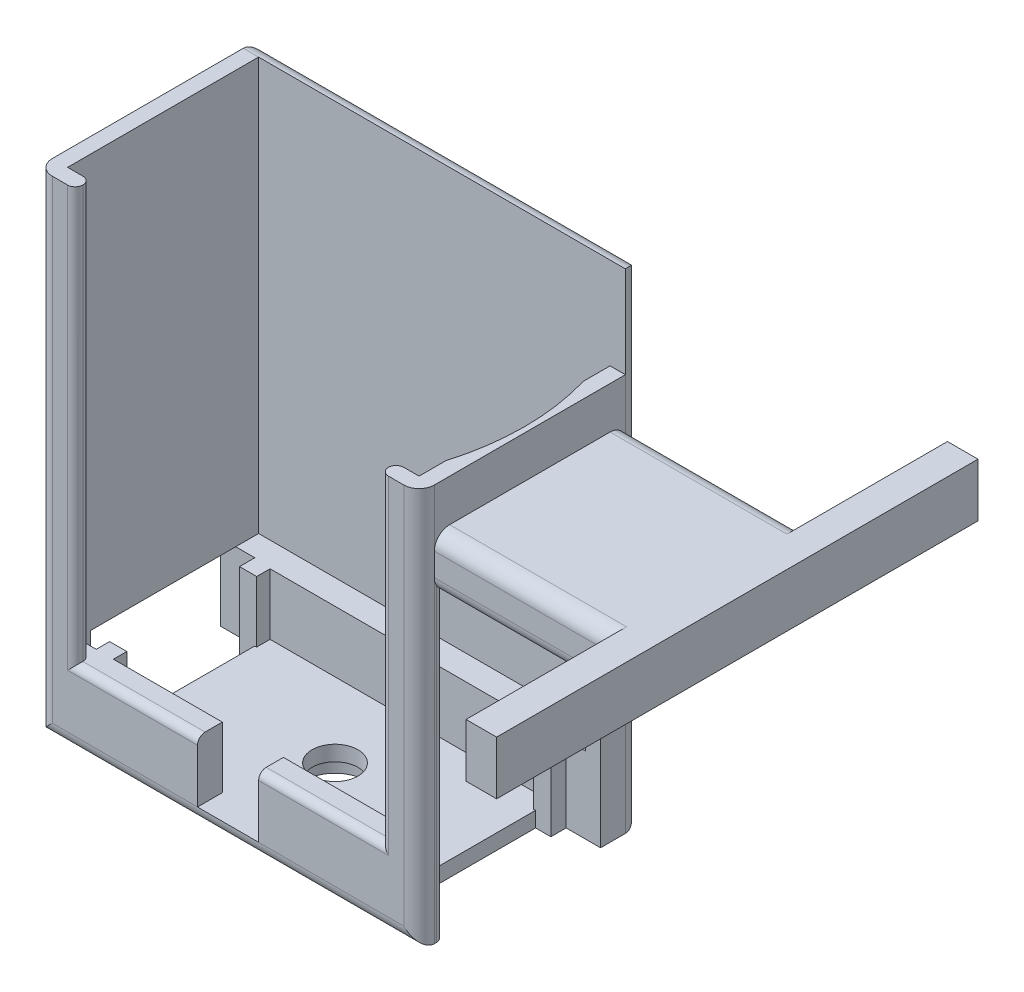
ISO-10303-21;
HEADER;
FILE_DESCRIPTION(('STEP AP214'),'2;1');
FILE_NAME('part.step','',(''),(''),'','','');
FILE_SCHEMA(('AUTOMOTIVE_DESIGN { 1 0 10303 214 1 1 1 1 }'));
ENDSEC;
DATA;
#1=APPLICATION_CONTEXT('core data for automotive mechanical design processes');
#2=APPLICATION_PROTOCOL_DEFINITION('international standard','automotive_design',2000,#1);
#3=PRODUCT_CONTEXT('',#1,'mechanical');
#4=PRODUCT('Part','Part','',(#3));
#5=PRODUCT_RELATED_PRODUCT_CATEGORY('part','',(#4));
#6=PRODUCT_DEFINITION_FORMATION('','',#4);
#7=PRODUCT_DEFINITION_CONTEXT('part definition',#1,'design');
#8=PRODUCT_DEFINITION('design','',#6,#7);
#9=PRODUCT_DEFINITION_SHAPE('','',#8);
#10=(LENGTH_UNIT() NAMED_UNIT(*) SI_UNIT(.MILLI.,.METRE.));
#11=(NAMED_UNIT(*) PLANE_ANGLE_UNIT() SI_UNIT($,.RADIAN.));
#12=(NAMED_UNIT(*) SI_UNIT($,.STERADIAN.) SOLID_ANGLE_UNIT());
#13=UNCERTAINTY_MEASURE_WITH_UNIT(LENGTH_MEASURE(1.E-05),#10,'distance_accuracy_value','');
#14=(GEOMETRIC_REPRESENTATION_CONTEXT(3) GLOBAL_UNCERTAINTY_ASSIGNED_CONTEXT((#13)) GLOBAL_UNIT_ASSIGNED_CONTEXT((#10,
#11,#12)) REPRESENTATION_CONTEXT('',''));
#15=CARTESIAN_POINT('',(0.,0.,0.));
#16=DIRECTION('',(0.,0.,1.));
#17=DIRECTION('',(1.,0.,0.));
#18=AXIS2_PLACEMENT_3D('',#15,#16,#17);
#19=CARTESIAN_POINT('',(-44.2838709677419,2.,27.7096774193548));
#20=DIRECTION('',(0.,-1.,0.));
#21=DIRECTION('',(0.,0.,-1.));
#22=AXIS2_PLACEMENT_3D('',#19,#20,#21);
#23=PLANE('',#22);
#24=CARTESIAN_POINT('',(-19.2838709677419,2.,13.7096774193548));
#25=DIRECTION('',(0.,-1.,0.));
#26=DIRECTION('',(0.,0.,-1.));
#27=AXIS2_PLACEMENT_3D('',#24,#25,#26);
#28=CIRCLE('',#27,3.);
#29=CARTESIAN_POINT('',(-19.2838709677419,2.,10.7096774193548));
#30=VERTEX_POINT('',#29);
#31=EDGE_CURVE('E754',#30,#30,#28,.T.);
#32=ORIENTED_EDGE('',*,*,#31,.T.);
#33=EDGE_LOOP('',(#32));
#34=FACE_BOUND('',#33,.T.);
#35=DIRECTION('',(-1.,0.,0.));
#36=VECTOR('',#35,1.);
#37=CARTESIAN_POINT('',(1.21612903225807,2.,22.4596774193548));
#38=LINE('',#37,#36);
#39=CARTESIAN_POINT('',(-0.783870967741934,2.,22.4596774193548));
#40=VERTEX_POINT('',#39);
#41=CARTESIAN_POINT('',(-1.03387096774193,2.,22.4596774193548));
#42=VERTEX_POINT('',#41);
#43=EDGE_CURVE('E472',#40,#42,#38,.T.);
#44=ORIENTED_EDGE('',*,*,#43,.F.);
#45=DIRECTION('',(0.,0.,-1.));
#46=VECTOR('',#45,1.);
#47=CARTESIAN_POINT('',(-0.783870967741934,2.,27.7096774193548));
#48=LINE('',#47,#46);
#49=CARTESIAN_POINT('',(-0.783870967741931,2.,5.95967741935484));
#50=VERTEX_POINT('',#49);
#51=EDGE_CURVE('E720',#40,#50,#48,.T.);
#52=ORIENTED_EDGE('',*,*,#51,.T.);
#53=DIRECTION('',(1.,0.,0.));
#54=VECTOR('',#53,1.);
#55=CARTESIAN_POINT('',(1.21612903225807,2.,5.95967741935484));
#56=LINE('',#55,#54);
#57=CARTESIAN_POINT('',(-1.03387096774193,2.,5.95967741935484));
#58=VERTEX_POINT('',#57);
#59=EDGE_CURVE('E2203',#58,#50,#56,.T.);
#60=ORIENTED_EDGE('',*,*,#59,.F.);
#61=DIRECTION('',(0.,0.,1.));
#62=VECTOR('',#61,1.);
#63=CARTESIAN_POINT('',(-1.03387096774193,2.,3.95967741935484));
#64=LINE('',#63,#62);
#65=CARTESIAN_POINT('',(-1.03387096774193,2.,3.95967741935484));
#66=VERTEX_POINT('',#65);
#67=EDGE_CURVE('E2206',#66,#58,#64,.T.);
#68=ORIENTED_EDGE('',*,*,#67,.F.);
#69=DIRECTION('',(1.,0.,0.));
#70=VECTOR('',#69,1.);
#71=CARTESIAN_POINT('',(-44.2838709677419,2.,3.95967741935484));
#72=LINE('',#71,#70);
#73=CARTESIAN_POINT('',(-37.5338709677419,2.,3.95967741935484));
#74=VERTEX_POINT('',#73);
#75=EDGE_CURVE('E494',#74,#66,#72,.T.);
#76=ORIENTED_EDGE('',*,*,#75,.F.);
#77=DIRECTION('',(0.,0.,-1.));
#78=VECTOR('',#77,1.);
#79=CARTESIAN_POINT('',(-37.5338709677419,2.,3.70967741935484));
#80=LINE('',#79,#78);
#81=CARTESIAN_POINT('',(-37.5338709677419,2.,5.70967741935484));
#82=VERTEX_POINT('',#81);
#83=EDGE_CURVE('E554',#82,#74,#80,.T.);
#84=ORIENTED_EDGE('',*,*,#83,.F.);
#85=DIRECTION('',(1.,0.,0.));
#86=VECTOR('',#85,1.);
#87=CARTESIAN_POINT('',(-39.7838709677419,2.,5.70967741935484));
#88=LINE('',#87,#86);
#89=CARTESIAN_POINT('',(-37.7838709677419,2.,5.70967741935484));
#90=VERTEX_POINT('',#89);
#91=EDGE_CURVE('E560',#90,#82,#88,.T.);
#92=ORIENTED_EDGE('',*,*,#91,.F.);
#93=DIRECTION('',(0.,0.,1.));
#94=VECTOR('',#93,1.);
#95=CARTESIAN_POINT('',(-37.7838709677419,2.,27.7096774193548));
#96=LINE('',#95,#94);
#97=CARTESIAN_POINT('',(-37.7838709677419,2.,22.7096774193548));
#98=VERTEX_POINT('',#97);
#99=EDGE_CURVE('E749',#90,#98,#96,.T.);
#100=ORIENTED_EDGE('',*,*,#99,.T.);
#101=DIRECTION('',(-1.,0.,0.));
#102=VECTOR('',#101,1.);
#103=CARTESIAN_POINT('',(-39.7838709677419,2.,22.7096774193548));
#104=LINE('',#103,#102);
#105=CARTESIAN_POINT('',(-37.5338709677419,2.,22.7096774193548));
#106=VERTEX_POINT('',#105);
#107=EDGE_CURVE('E58',#106,#98,#104,.T.);
#108=ORIENTED_EDGE('',*,*,#107,.F.);
#109=DIRECTION('',(0.,0.,-1.));
#110=VECTOR('',#109,1.);
#111=CARTESIAN_POINT('',(-37.5338709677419,2.,22.7096774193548));
#112=LINE('',#111,#110);
#113=CARTESIAN_POINT('',(-37.5338709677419,2.,24.4596774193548));
#114=VERTEX_POINT('',#113);
#115=EDGE_CURVE('E2216',#114,#106,#112,.T.);
#116=ORIENTED_EDGE('',*,*,#115,.F.);
#117=DIRECTION('',(-1.,0.,0.));
#118=VECTOR('',#117,1.);
#119=CARTESIAN_POINT('',(5.71612903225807,2.,24.4596774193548));
#120=LINE('',#119,#118);
#121=CARTESIAN_POINT('',(-23.2838709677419,2.,24.4596774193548));
#122=VERTEX_POINT('',#121);
#123=EDGE_CURVE('E487',#122,#114,#120,.T.);
#124=ORIENTED_EDGE('',*,*,#123,.F.);
#125=DIRECTION('',(0.,0.,1.));
#126=VECTOR('',#125,1.);
#127=CARTESIAN_POINT('',(-23.2838709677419,2.,22.7096774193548));
#128=LINE('',#127,#126);
#129=CARTESIAN_POINT('',(-23.2838709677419,2.,27.7096774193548));
#130=VERTEX_POINT('',#129);
#131=EDGE_CURVE('E679',#122,#130,#128,.T.);
#132=ORIENTED_EDGE('',*,*,#131,.T.);
#133=DIRECTION('',(1.,0.,0.));
#134=VECTOR('',#133,1.);
#135=CARTESIAN_POINT('',(-23.2838709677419,2.,27.7096774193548));
#136=LINE('',#135,#134);
#137=CARTESIAN_POINT('',(-15.2838709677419,2.,27.7096774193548));
#138=VERTEX_POINT('',#137);
#139=EDGE_CURVE('E675',#130,#138,#136,.T.);
#140=ORIENTED_EDGE('',*,*,#139,.T.);
#141=DIRECTION('',(0.,0.,1.));
#142=VECTOR('',#141,1.);
#143=CARTESIAN_POINT('',(-15.2838709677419,2.,22.7096774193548));
#144=LINE('',#143,#142);
#145=CARTESIAN_POINT('',(-15.2838709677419,2.,24.4596774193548));
#146=VERTEX_POINT('',#145);
#147=EDGE_CURVE('E485',#146,#138,#144,.T.);
#148=ORIENTED_EDGE('',*,*,#147,.F.);
#149=CARTESIAN_POINT('',(-1.03387096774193,2.,24.4596774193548));
#150=VERTEX_POINT('',#149);
#151=EDGE_CURVE('E478',#150,#146,#120,.T.);
#152=ORIENTED_EDGE('',*,*,#151,.F.);
#153=DIRECTION('',(0.,0.,1.));
#154=VECTOR('',#153,1.);
#155=CARTESIAN_POINT('',(-1.03387096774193,2.,22.4596774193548));
#156=LINE('',#155,#154);
#157=EDGE_CURVE('E463',#42,#150,#156,.T.);
#158=ORIENTED_EDGE('',*,*,#157,.F.);
#159=EDGE_LOOP('',(#44,#52,#60,#68,#76,#84,#92,#100,#108,#116,#124,#132,#140,#148,#152,#158));
#160=FACE_BOUND('',#159,.T.);
#161=ADVANCED_FACE('F43',(#34,#160),#23,.F.);
#162=CARTESIAN_POINT('',(5.71612903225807,10.,24.4596774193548));
#163=DIRECTION('',(0.,0.,1.));
#164=DIRECTION('',(1.,0.,0.));
#165=AXIS2_PLACEMENT_3D('',#162,#163,#164);
#166=PLANE('',#165);
#167=DIRECTION('',(0.,-1.,0.));
#168=VECTOR('',#167,1.);
#169=CARTESIAN_POINT('',(1.21612903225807,2.,24.4596774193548));
#170=LINE('',#169,#168);
#171=CARTESIAN_POINT('',(1.21612903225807,10.,24.4596774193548));
#172=VERTEX_POINT('',#171);
#173=CARTESIAN_POINT('',(1.21612903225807,0.,24.4596774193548));
#174=VERTEX_POINT('',#173);
#175=EDGE_CURVE('E582',#172,#174,#170,.T.);
#176=ORIENTED_EDGE('',*,*,#175,.F.);
#177=DIRECTION('',(-1.,0.,0.));
#178=VECTOR('',#177,1.);
#179=CARTESIAN_POINT('',(5.71612903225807,10.,24.4596774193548));
#180=LINE('',#179,#178);
#181=CARTESIAN_POINT('',(3.71612903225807,10.,24.4596774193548));
#182=VERTEX_POINT('',#181);
#183=EDGE_CURVE('E513',#182,#172,#180,.T.);
#184=ORIENTED_EDGE('',*,*,#183,.F.);
#185=DIRECTION('',(0.,-1.,0.));
#186=VECTOR('',#185,1.);
#187=CARTESIAN_POINT('',(3.71612903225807,52.,24.4596774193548));
#188=LINE('',#187,#186);
#189=CARTESIAN_POINT('',(3.71612903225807,39.6459503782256,24.4596774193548));
#190=VERTEX_POINT('',#189);
#191=EDGE_CURVE('E820',#190,#182,#188,.T.);
#192=ORIENTED_EDGE('',*,*,#191,.F.);
#193=DIRECTION('',(-1.,0.,0.));
#194=VECTOR('',#193,1.);
#195=CARTESIAN_POINT('',(3.71612903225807,39.6459503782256,24.4596774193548));
#196=LINE('',#195,#194);
#197=CARTESIAN_POINT('',(4.71612903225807,39.6459503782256,24.4596774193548));
#198=VERTEX_POINT('',#197);
#199=EDGE_CURVE('E955',#190,#198,#196,.F.);
#200=ORIENTED_EDGE('',*,*,#199,.T.);
#201=DIRECTION('',(0.,-1.,0.));
#202=VECTOR('',#201,1.);
#203=CARTESIAN_POINT('',(4.71612903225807,10.,24.4596774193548));
#204=LINE('',#203,#202);
#205=CARTESIAN_POINT('',(4.71612903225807,0.,24.4596774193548));
#206=VERTEX_POINT('',#205);
#207=EDGE_CURVE('E898',#198,#206,#204,.T.);
#208=ORIENTED_EDGE('',*,*,#207,.T.);
#209=DIRECTION('',(-1.,0.,0.));
#210=VECTOR('',#209,1.);
#211=CARTESIAN_POINT('',(5.71612903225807,0.,24.4596774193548));
#212=LINE('',#211,#210);
#213=EDGE_CURVE('E707',#206,#174,#212,.T.);
#214=ORIENTED_EDGE('',*,*,#213,.T.);
#215=EDGE_LOOP('',(#176,#184,#192,#200,#208,#214));
#216=FACE_BOUND('',#215,.T.);
#217=ADVANCED_FACE('F1066',(#216),#166,.F.);
#218=DIRECTION('',(0.,-1.,0.));
#219=VECTOR('',#218,1.);
#220=CARTESIAN_POINT('',(-1.03387096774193,10.,24.4596774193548));
#221=LINE('',#220,#219);
#222=CARTESIAN_POINT('',(-1.03387096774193,10.,24.4596774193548));
#223=VERTEX_POINT('',#222);
#224=EDGE_CURVE('E467',#223,#150,#221,.T.);
#225=ORIENTED_EDGE('',*,*,#224,.T.);
#226=ORIENTED_EDGE('',*,*,#151,.T.);
#227=DIRECTION('',(0.,1.,0.));
#228=VECTOR('',#227,1.);
#229=CARTESIAN_POINT('',(-15.2838709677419,10.,24.4596774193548));
#230=LINE('',#229,#228);
#231=CARTESIAN_POINT('',(-15.2838709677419,10.,24.4596774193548));
#232=VERTEX_POINT('',#231);
#233=EDGE_CURVE('E681',#146,#232,#230,.T.);
#234=ORIENTED_EDGE('',*,*,#233,.T.);
#235=EDGE_CURVE('E480',#223,#232,#180,.T.);
#236=ORIENTED_EDGE('',*,*,#235,.F.);
#237=EDGE_LOOP('',(#225,#226,#234,#236));
#238=FACE_BOUND('',#237,.T.);
#239=ADVANCED_FACE('F476',(#238),#166,.F.);
#240=CARTESIAN_POINT('',(-44.2838709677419,10.,3.95967741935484));
#241=DIRECTION('',(0.,0.,-1.));
#242=DIRECTION('',(-1.,0.,0.));
#243=AXIS2_PLACEMENT_3D('',#240,#241,#242);
#244=PLANE('',#243);
#245=DIRECTION('',(1.,0.,0.));
#246=VECTOR('',#245,1.);
#247=CARTESIAN_POINT('',(-44.2838709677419,10.,3.95967741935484));
#248=LINE('',#247,#246);
#249=CARTESIAN_POINT('',(1.21612903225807,10.,3.95967741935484));
#250=VERTEX_POINT('',#249);
#251=CARTESIAN_POINT('',(3.71612903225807,10.,3.95967741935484));
#252=VERTEX_POINT('',#251);
#253=EDGE_CURVE('E505',#250,#252,#248,.T.);
#254=ORIENTED_EDGE('',*,*,#253,.F.);
#255=DIRECTION('',(0.,1.,0.));
#256=VECTOR('',#255,1.);
#257=CARTESIAN_POINT('',(1.21612903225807,0.,3.95967741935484));
#258=LINE('',#257,#256);
#259=CARTESIAN_POINT('',(1.21612903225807,0.,3.95967741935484));
#260=VERTEX_POINT('',#259);
#261=EDGE_CURVE('E576',#260,#250,#258,.T.);
#262=ORIENTED_EDGE('',*,*,#261,.F.);
#263=DIRECTION('',(1.,0.,0.));
#264=VECTOR('',#263,1.);
#265=CARTESIAN_POINT('',(5.71612903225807,0.,3.95967741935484));
#266=LINE('',#265,#264);
#267=CARTESIAN_POINT('',(5.71612903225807,0.,3.95967741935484));
#268=VERTEX_POINT('',#267);
#269=EDGE_CURVE('E712',#260,#268,#266,.T.);
#270=ORIENTED_EDGE('',*,*,#269,.T.);
#271=DIRECTION('',(0.,-1.,0.));
#272=VECTOR('',#271,1.);
#273=CARTESIAN_POINT('',(5.71612903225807,39.5,3.95967741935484));
#274=LINE('',#273,#272);
#275=CARTESIAN_POINT('',(5.71612903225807,39.5,3.95967741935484));
#276=VERTEX_POINT('',#275);
#277=EDGE_CURVE('E711',#276,#268,#274,.T.);
#278=ORIENTED_EDGE('',*,*,#277,.F.);
#279=DIRECTION('',(1.,0.,0.));
#280=VECTOR('',#279,1.);
#281=CARTESIAN_POINT('',(5.71612903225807,39.5,3.95967741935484));
#282=LINE('',#281,#280);
#283=CARTESIAN_POINT('',(3.71612903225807,39.5,3.95967741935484));
#284=VERTEX_POINT('',#283);
#285=EDGE_CURVE('E708',#284,#276,#282,.T.);
#286=ORIENTED_EDGE('',*,*,#285,.F.);
#287=DIRECTION('',(0.,1.,0.));
#288=VECTOR('',#287,1.);
#289=CARTESIAN_POINT('',(3.71612903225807,52.,3.95967741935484));
#290=LINE('',#289,#288);
#291=EDGE_CURVE('E823',#252,#284,#290,.T.);
#292=ORIENTED_EDGE('',*,*,#291,.F.);
#293=EDGE_LOOP('',(#254,#262,#270,#278,#286,#292));
#294=FACE_BOUND('',#293,.T.);
#295=ADVANCED_FACE('F1078',(#294),#244,.F.);
#296=DIRECTION('',(0.,-1.,0.));
#297=VECTOR('',#296,1.);
#298=CARTESIAN_POINT('',(-1.03387096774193,10.,3.95967741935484));
#299=LINE('',#298,#297);
#300=CARTESIAN_POINT('',(-1.03387096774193,10.,3.95967741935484));
#301=VERTEX_POINT('',#300);
#302=EDGE_CURVE('E2239',#301,#66,#299,.T.);
#303=ORIENTED_EDGE('',*,*,#302,.F.);
#304=CARTESIAN_POINT('',(-37.5338709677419,10.,3.95967741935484));
#305=VERTEX_POINT('',#304);
#306=EDGE_CURVE('E498',#305,#301,#248,.T.);
#307=ORIENTED_EDGE('',*,*,#306,.F.);
#308=DIRECTION('',(0.,1.,0.));
#309=VECTOR('',#308,1.);
#310=CARTESIAN_POINT('',(-37.5338709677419,10.,3.95967741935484));
#311=LINE('',#310,#309);
#312=EDGE_CURVE('E566',#74,#305,#311,.T.);
#313=ORIENTED_EDGE('',*,*,#312,.F.);
#314=ORIENTED_EDGE('',*,*,#75,.T.);
#315=EDGE_LOOP('',(#303,#307,#313,#314));
#316=FACE_BOUND('',#315,.T.);
#317=ADVANCED_FACE('F1060',(#316),#244,.F.);
#318=DIRECTION('',(0.,0.,1.));
#319=VECTOR('',#318,1.);
#320=CARTESIAN_POINT('',(-39.7838709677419,2.,22.7096774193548));
#321=LINE('',#320,#319);
#322=CARTESIAN_POINT('',(-39.7838709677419,2.,22.7096774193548));
#323=VERTEX_POINT('',#322);
#324=CARTESIAN_POINT('',(-39.7838709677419,2.,24.4596774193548));
#325=VERTEX_POINT('',#324);
#326=EDGE_CURVE('E562',#323,#325,#321,.T.);
#327=ORIENTED_EDGE('',*,*,#326,.F.);
#328=DIRECTION('',(-1.,0.,0.));
#329=VECTOR('',#328,1.);
#330=CARTESIAN_POINT('',(-44.2838709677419,2.,22.7096774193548));
#331=LINE('',#330,#329);
#332=CARTESIAN_POINT('',(-42.2838709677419,2.,22.7096774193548));
#333=VERTEX_POINT('',#332);
#334=EDGE_CURVE('E742',#323,#333,#331,.T.);
#335=ORIENTED_EDGE('',*,*,#334,.T.);
#336=DIRECTION('',(0.,0.,-1.));
#337=VECTOR('',#336,1.);
#338=CARTESIAN_POINT('',(-42.2838709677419,2.,27.7096774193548));
#339=LINE('',#338,#337);
#340=CARTESIAN_POINT('',(-42.2838709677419,2.,24.4596774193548));
#341=VERTEX_POINT('',#340);
#342=EDGE_CURVE('E776',#341,#333,#339,.T.);
#343=ORIENTED_EDGE('',*,*,#342,.F.);
#344=EDGE_CURVE('E489',#325,#341,#120,.T.);
#345=ORIENTED_EDGE('',*,*,#344,.F.);
#346=EDGE_LOOP('',(#327,#335,#343,#345));
#347=FACE_BOUND('',#346,.T.);
#348=ADVANCED_FACE('F798',(#347),#23,.F.);
#349=DIRECTION('',(0.,-1.,0.));
#350=VECTOR('',#349,1.);
#351=CARTESIAN_POINT('',(-39.7838709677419,10.,24.4596774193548));
#352=LINE('',#351,#350);
#353=CARTESIAN_POINT('',(-39.7838709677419,10.,24.4596774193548));
#354=VERTEX_POINT('',#353);
#355=EDGE_CURVE('E66',#354,#325,#352,.T.);
#356=ORIENTED_EDGE('',*,*,#355,.T.);
#357=ORIENTED_EDGE('',*,*,#344,.T.);
#358=DIRECTION('',(0.,-1.,0.));
#359=VECTOR('',#358,1.);
#360=CARTESIAN_POINT('',(-42.2838709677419,10.,24.4596774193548));
#361=LINE('',#360,#359);
#362=CARTESIAN_POINT('',(-42.2838709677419,10.,24.4596774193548));
#363=VERTEX_POINT('',#362);
#364=EDGE_CURVE('E509',#363,#341,#361,.T.);
#365=ORIENTED_EDGE('',*,*,#364,.F.);
#366=EDGE_CURVE('E486',#354,#363,#180,.T.);
#367=ORIENTED_EDGE('',*,*,#366,.F.);
#368=EDGE_LOOP('',(#356,#357,#365,#367));
#369=FACE_BOUND('',#368,.T.);
#370=ADVANCED_FACE('F1059',(#369),#166,.F.);
#371=DIRECTION('',(0.,-1.,0.));
#372=VECTOR('',#371,1.);
#373=CARTESIAN_POINT('',(-37.5338709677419,10.,24.4596774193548));
#374=LINE('',#373,#372);
#375=CARTESIAN_POINT('',(-37.5338709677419,10.,24.4596774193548));
#376=VERTEX_POINT('',#375);
#377=EDGE_CURVE('E537',#376,#114,#374,.T.);
#378=ORIENTED_EDGE('',*,*,#377,.F.);
#379=CARTESIAN_POINT('',(-23.2838709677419,10.,24.4596774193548));
#380=VERTEX_POINT('',#379);
#381=EDGE_CURVE('E490',#380,#376,#180,.T.);
#382=ORIENTED_EDGE('',*,*,#381,.F.);
#383=DIRECTION('',(0.,-1.,0.));
#384=VECTOR('',#383,1.);
#385=CARTESIAN_POINT('',(-23.2838709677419,10.,24.4596774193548));
#386=LINE('',#385,#384);
#387=EDGE_CURVE('E688',#380,#122,#386,.T.);
#388=ORIENTED_EDGE('',*,*,#387,.T.);
#389=ORIENTED_EDGE('',*,*,#123,.T.);
#390=EDGE_LOOP('',(#378,#382,#388,#389));
#391=FACE_BOUND('',#390,.T.);
#392=ADVANCED_FACE('F1070',(#391),#166,.F.);
#393=CARTESIAN_POINT('',(-44.2838709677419,10.,3.70967741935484));
#394=DIRECTION('',(0.,0.,-1.));
#395=DIRECTION('',(-1.,0.,0.));
#396=AXIS2_PLACEMENT_3D('',#393,#394,#395);
#397=PLANE('',#396);
#398=DIRECTION('',(0.,-1.,0.));
#399=VECTOR('',#398,1.);
#400=CARTESIAN_POINT('',(-39.7838709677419,0.,3.70967741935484));
#401=LINE('',#400,#399);
#402=CARTESIAN_POINT('',(-39.7838709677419,10.,3.70967741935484));
#403=VERTEX_POINT('',#402);
#404=CARTESIAN_POINT('',(-39.7838709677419,0.,3.70967741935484));
#405=VERTEX_POINT('',#404);
#406=EDGE_CURVE('E594',#403,#405,#401,.T.);
#407=ORIENTED_EDGE('',*,*,#406,.F.);
#408=DIRECTION('',(1.,0.,0.));
#409=VECTOR('',#408,1.);
#410=CARTESIAN_POINT('',(-44.2838709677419,10.,3.70967741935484));
#411=LINE('',#410,#409);
#412=CARTESIAN_POINT('',(-42.2838709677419,10.,3.70967741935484));
#413=VERTEX_POINT('',#412);
#414=EDGE_CURVE('E727',#413,#403,#411,.T.);
#415=ORIENTED_EDGE('',*,*,#414,.F.);
#416=CARTESIAN_POINT('',(-44.2838709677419,10.,3.70967741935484));
#417=VERTEX_POINT('',#416);
#418=EDGE_CURVE('E729',#417,#413,#411,.T.);
#419=ORIENTED_EDGE('',*,*,#418,.F.);
#420=DIRECTION('',(0.,-1.,0.));
#421=VECTOR('',#420,1.);
#422=CARTESIAN_POINT('',(-44.2838709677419,10.,3.70967741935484));
#423=LINE('',#422,#421);
#424=CARTESIAN_POINT('',(-44.2838709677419,0.,3.70967741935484));
#425=VERTEX_POINT('',#424);
#426=EDGE_CURVE('E734',#417,#425,#423,.T.);
#427=ORIENTED_EDGE('',*,*,#426,.T.);
#428=DIRECTION('',(1.,0.,0.));
#429=VECTOR('',#428,1.);
#430=CARTESIAN_POINT('',(-44.2838709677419,0.,3.70967741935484));
#431=LINE('',#430,#429);
#432=EDGE_CURVE('E723',#425,#405,#431,.T.);
#433=ORIENTED_EDGE('',*,*,#432,.T.);
#434=EDGE_LOOP('',(#407,#415,#419,#427,#433));
#435=FACE_BOUND('',#434,.T.);
#436=ADVANCED_FACE('F1095',(#435),#397,.F.);
#437=CARTESIAN_POINT('',(-0.783870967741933,39.5,24.4596774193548));
#438=DIRECTION('',(-1.,0.,0.));
#439=DIRECTION('',(0.,0.,1.));
#440=AXIS2_PLACEMENT_3D('',#437,#438,#439);
#441=PLANE('',#440);
#442=DIRECTION('',(0.,-1.,0.));
#443=VECTOR('',#442,1.);
#444=CARTESIAN_POINT('',(-0.783870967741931,0.,5.95967741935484));
#445=LINE('',#444,#443);
#446=CARTESIAN_POINT('',(-0.783870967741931,0.,5.95967741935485));
#447=VERTEX_POINT('',#446);
#448=EDGE_CURVE('E572',#50,#447,#445,.T.);
#449=ORIENTED_EDGE('',*,*,#448,.F.);
#450=ORIENTED_EDGE('',*,*,#51,.F.);
#451=DIRECTION('',(0.,1.,0.));
#452=VECTOR('',#451,1.);
#453=CARTESIAN_POINT('',(-0.783870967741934,2.,22.4596774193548));
#454=LINE('',#453,#452);
#455=CARTESIAN_POINT('',(-0.783870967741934,0.,22.4596774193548));
#456=VERTEX_POINT('',#455);
#457=EDGE_CURVE('E575',#456,#40,#454,.T.);
#458=ORIENTED_EDGE('',*,*,#457,.F.);
#459=DIRECTION('',(0.,0.,-1.));
#460=VECTOR('',#459,1.);
#461=CARTESIAN_POINT('',(-0.783870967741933,0.,24.4596774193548));
#462=LINE('',#461,#460);
#463=EDGE_CURVE('E715',#456,#447,#462,.T.);
#464=ORIENTED_EDGE('',*,*,#463,.T.);
#465=EDGE_LOOP('',(#449,#450,#458,#464));
#466=FACE_BOUND('',#465,.T.);
#467=ADVANCED_FACE('F1098',(#466),#441,.F.);
#468=CARTESIAN_POINT('',(-37.7838709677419,10.,22.7096774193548));
#469=DIRECTION('',(1.,0.,0.));
#470=DIRECTION('',(0.,0.,-1.));
#471=AXIS2_PLACEMENT_3D('',#468,#469,#470);
#472=PLANE('',#471);
#473=DIRECTION('',(0.,1.,0.));
#474=VECTOR('',#473,1.);
#475=CARTESIAN_POINT('',(-37.7838709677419,0.,5.70967741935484));
#476=LINE('',#475,#474);
#477=CARTESIAN_POINT('',(-37.7838709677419,0.,5.70967741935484));
#478=VERTEX_POINT('',#477);
#479=EDGE_CURVE('E593',#478,#90,#476,.T.);
#480=ORIENTED_EDGE('',*,*,#479,.F.);
#481=DIRECTION('',(0.,0.,1.));
#482=VECTOR('',#481,1.);
#483=CARTESIAN_POINT('',(-37.7838709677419,0.,22.7096774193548));
#484=LINE('',#483,#482);
#485=CARTESIAN_POINT('',(-37.7838709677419,0.,22.7096774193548));
#486=VERTEX_POINT('',#485);
#487=EDGE_CURVE('E736',#478,#486,#484,.T.);
#488=ORIENTED_EDGE('',*,*,#487,.T.);
#489=DIRECTION('',(0.,-1.,0.));
#490=VECTOR('',#489,1.);
#491=CARTESIAN_POINT('',(-37.7838709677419,10.,22.7096774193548));
#492=LINE('',#491,#490);
#493=EDGE_CURVE('E743',#98,#486,#492,.T.);
#494=ORIENTED_EDGE('',*,*,#493,.F.);
#495=ORIENTED_EDGE('',*,*,#99,.F.);
#496=EDGE_LOOP('',(#480,#488,#494,#495));
#497=FACE_BOUND('',#496,.T.);
#498=ADVANCED_FACE('F1100',(#497),#472,.F.);
#499=CARTESIAN_POINT('',(3.71612903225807,52.,27.7096774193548));
#500=DIRECTION('',(1.,0.,0.));
#501=DIRECTION('',(0.,0.,-1.));
#502=AXIS2_PLACEMENT_3D('',#499,#500,#501);
#503=PLANE('',#502);
#504=DIRECTION('',(0.,0.,1.));
#505=VECTOR('',#504,1.);
#506=CARTESIAN_POINT('',(3.71612903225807,39.5,27.7096774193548));
#507=LINE('',#506,#505);
#508=CARTESIAN_POINT('',(3.71612903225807,39.5,4.20967741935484));
#509=VERTEX_POINT('',#508);
#510=EDGE_CURVE('E812',#284,#509,#507,.T.);
#511=ORIENTED_EDGE('',*,*,#510,.T.);
#512=DIRECTION('',(0.,1.,0.));
#513=VECTOR('',#512,1.);
#514=CARTESIAN_POINT('',(3.71612903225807,30.,4.20967741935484));
#515=LINE('',#514,#513);
#516=CARTESIAN_POINT('',(3.71612903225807,52.,4.20967741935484));
#517=VERTEX_POINT('',#516);
#518=EDGE_CURVE('E608',#509,#517,#515,.T.);
#519=ORIENTED_EDGE('',*,*,#518,.T.);
#520=DIRECTION('',(0.,0.,1.));
#521=VECTOR('',#520,1.);
#522=CARTESIAN_POINT('',(3.71612903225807,52.,27.7096774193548));
#523=LINE('',#522,#521);
#524=CARTESIAN_POINT('',(3.71612903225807,52.,0.709677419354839));
#525=VERTEX_POINT('',#524);
#526=EDGE_CURVE('E761',#525,#517,#523,.T.);
#527=ORIENTED_EDGE('',*,*,#526,.F.);
#528=DIRECTION('',(0.,-1.,0.));
#529=VECTOR('',#528,1.);
#530=CARTESIAN_POINT('',(3.71612903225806,64.,0.709677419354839));
#531=LINE('',#530,#529);
#532=CARTESIAN_POINT('',(3.71612903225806,10.,0.709677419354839));
#533=VERTEX_POINT('',#532);
#534=EDGE_CURVE('E768',#525,#533,#531,.T.);
#535=ORIENTED_EDGE('',*,*,#534,.T.);
#536=DIRECTION('',(0.,0.,-1.));
#537=VECTOR('',#536,1.);
#538=CARTESIAN_POINT('',(3.71612903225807,10.,0.));
#539=LINE('',#538,#537);
#540=EDGE_CURVE('E766',#252,#533,#539,.T.);
#541=ORIENTED_EDGE('',*,*,#540,.F.);
#542=ORIENTED_EDGE('',*,*,#291,.T.);
#543=EDGE_LOOP('',(#511,#519,#527,#535,#541,#542));
#544=FACE_BOUND('',#543,.T.);
#545=ADVANCED_FACE('F1087',(#544),#503,.F.);
#546=CARTESIAN_POINT('',(0.,0.,0.));
#547=DIRECTION('',(0.,1.,0.));
#548=DIRECTION('',(0.,0.,1.));
#549=AXIS2_PLACEMENT_3D('',#546,#547,#548);
#550=PLANE('',#549);
#551=CARTESIAN_POINT('',(-19.2838709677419,0.,13.7096774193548));
#552=DIRECTION('',(0.,-1.,0.));
#553=DIRECTION('',(0.,0.,-1.));
#554=AXIS2_PLACEMENT_3D('',#551,#552,#553);
#555=CIRCLE('',#554,3.);
#556=CARTESIAN_POINT('',(-19.2838709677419,0.,10.7096774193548));
#557=VERTEX_POINT('',#556);
#558=EDGE_CURVE('E751',#557,#557,#555,.T.);
#559=ORIENTED_EDGE('',*,*,#558,.F.);
#560=EDGE_LOOP('',(#559));
#561=FACE_BOUND('',#560,.T.);
#562=CARTESIAN_POINT('',(-19.2838709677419,0.,13.7096774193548));
#563=DIRECTION('',(0.,-1.,0.));
#564=DIRECTION('',(0.,0.,-1.));
#565=AXIS2_PLACEMENT_3D('',#562,#563,#564);
#566=CIRCLE('',#565,4.);
#567=CARTESIAN_POINT('',(-19.2838709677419,0.,9.70967741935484));
#568=VERTEX_POINT('',#567);
#569=EDGE_CURVE('E611',#568,#568,#566,.T.);
#570=ORIENTED_EDGE('',*,*,#569,.T.);
#571=EDGE_LOOP('',(#570));
#572=FACE_BOUND('',#571,.T.);
#573=ADVANCED_FACE('F1042',(#561,#572),#550,.F.);
#574=CARTESIAN_POINT('',(5.71612903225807,64.,-1.29032258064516));
#575=DIRECTION('',(-1.,0.,0.));
#576=DIRECTION('',(0.,0.,1.));
#577=AXIS2_PLACEMENT_3D('',#574,#575,#576);
#578=PLANE('',#577);
#579=DIRECTION('',(0.,-1.,0.));
#580=VECTOR('',#579,1.);
#581=CARTESIAN_POINT('',(5.71612903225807,64.,25.4596774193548));
#582=LINE('',#581,#580);
#583=CARTESIAN_POINT('',(5.71612903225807,0.,25.4596774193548));
#584=VERTEX_POINT('',#583);
#585=CARTESIAN_POINT('',(5.71612903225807,40.5317541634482,25.4596774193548));
#586=VERTEX_POINT('',#585);
#587=EDGE_CURVE('E903',#584,#586,#582,.F.);
#588=ORIENTED_EDGE('',*,*,#587,.T.);
#589=CARTESIAN_POINT('',(5.71612903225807,41.5,23.7096774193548));
#590=DIRECTION('',(-1.,0.,0.));
#591=DIRECTION('',(0.,0.,1.));
#592=AXIS2_PLACEMENT_3D('',#589,#590,#591);
#593=CIRCLE('',#592,2.);
#594=CARTESIAN_POINT('',(5.71612903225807,41.5,25.7096774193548));
#595=VERTEX_POINT('',#594);
#596=EDGE_CURVE('E967',#586,#595,#593,.T.);
#597=ORIENTED_EDGE('',*,*,#596,.T.);
#598=DIRECTION('',(0.,1.,0.));
#599=VECTOR('',#598,1.);
#600=CARTESIAN_POINT('',(5.71612903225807,64.,25.7096774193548));
#601=LINE('',#600,#599);
#602=CARTESIAN_POINT('',(5.71612903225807,0.,25.7096774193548));
#603=VERTEX_POINT('',#602);
#604=EDGE_CURVE('E853',#595,#603,#601,.F.);
#605=ORIENTED_EDGE('',*,*,#604,.T.);
#606=DIRECTION('',(0.,0.,-1.));
#607=VECTOR('',#606,1.);
#608=CARTESIAN_POINT('',(5.71612903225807,0.,-1.29032258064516));
#609=LINE('',#608,#607);
#610=EDGE_CURVE('E2109',#603,#584,#609,.T.);
#611=ORIENTED_EDGE('',*,*,#610,.T.);
#612=EDGE_LOOP('',(#588,#597,#605,#611));
#613=FACE_BOUND('',#612,.T.);
#614=ADVANCED_FACE('F1038',(#613),#578,.F.);
#615=DIRECTION('',(0.,0.,-1.));
#616=VECTOR('',#615,1.);
#617=CARTESIAN_POINT('',(5.71612903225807,39.5,25.7096774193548));
#618=LINE('',#617,#616);
#619=CARTESIAN_POINT('',(5.71612903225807,39.5,2.70967741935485));
#620=VERTEX_POINT('',#619);
#621=EDGE_CURVE('E665',#276,#620,#618,.T.);
#622=ORIENTED_EDGE('',*,*,#621,.F.);
#623=ORIENTED_EDGE('',*,*,#277,.T.);
#624=CARTESIAN_POINT('',(5.71612903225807,0.,0.709677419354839));
#625=VERTEX_POINT('',#624);
#626=EDGE_CURVE('E2148',#268,#625,#609,.T.);
#627=ORIENTED_EDGE('',*,*,#626,.T.);
#628=DIRECTION('',(0.,-1.,0.));
#629=VECTOR('',#628,1.);
#630=CARTESIAN_POINT('',(5.71612903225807,64.,0.709677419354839));
#631=LINE('',#630,#629);
#632=CARTESIAN_POINT('',(5.71612903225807,41.5,0.709677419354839));
#633=VERTEX_POINT('',#632);
#634=EDGE_CURVE('E851',#625,#633,#631,.F.);
#635=ORIENTED_EDGE('',*,*,#634,.T.);
#636=CARTESIAN_POINT('',(5.71612903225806,41.5,2.70967741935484));
#637=DIRECTION('',(-1.,0.,0.));
#638=DIRECTION('',(0.,0.,1.));
#639=AXIS2_PLACEMENT_3D('',#636,#637,#638);
#640=CIRCLE('',#639,2.);
#641=EDGE_CURVE('E2064',#633,#620,#640,.T.);
#642=ORIENTED_EDGE('',*,*,#641,.T.);
#643=EDGE_LOOP('',(#622,#623,#627,#635,#642));
#644=FACE_BOUND('',#643,.T.);
#645=ADVANCED_FACE('F1041',(#644),#578,.F.);
#646=DIRECTION('',(0.,0.,1.));
#647=VECTOR('',#646,1.);
#648=CARTESIAN_POINT('',(5.71612903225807,46.5,25.7096774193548));
#649=LINE('',#648,#647);
#650=CARTESIAN_POINT('',(5.71612903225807,46.5,2.70967741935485));
#651=VERTEX_POINT('',#650);
#652=CARTESIAN_POINT('',(5.71612903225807,46.5,23.7096774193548));
#653=VERTEX_POINT('',#652);
#654=EDGE_CURVE('E659',#651,#653,#649,.T.);
#655=ORIENTED_EDGE('',*,*,#654,.F.);
#656=CARTESIAN_POINT('',(5.71612903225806,44.5,2.70967741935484));
#657=DIRECTION('',(-1.,0.,0.));
#658=DIRECTION('',(0.,0.,1.));
#659=AXIS2_PLACEMENT_3D('',#656,#657,#658);
#660=CIRCLE('',#659,2.);
#661=CARTESIAN_POINT('',(5.71612903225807,44.5,0.709677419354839));
#662=VERTEX_POINT('',#661);
#663=EDGE_CURVE('E2072',#651,#662,#660,.T.);
#664=ORIENTED_EDGE('',*,*,#663,.T.);
#665=CARTESIAN_POINT('',(5.71612903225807,52.,0.709677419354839));
#666=VERTEX_POINT('',#665);
#667=EDGE_CURVE('E850',#662,#666,#631,.F.);
#668=ORIENTED_EDGE('',*,*,#667,.T.);
#669=DIRECTION('',(0.,0.,-1.));
#670=VECTOR('',#669,1.);
#671=CARTESIAN_POINT('',(5.71612903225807,52.,27.7096774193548));
#672=LINE('',#671,#670);
#673=CARTESIAN_POINT('',(5.71612903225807,52.,25.7096774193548));
#674=VERTEX_POINT('',#673);
#675=EDGE_CURVE('E757',#674,#666,#672,.T.);
#676=ORIENTED_EDGE('',*,*,#675,.F.);
#677=CARTESIAN_POINT('',(5.71612903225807,44.5,25.7096774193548));
#678=VERTEX_POINT('',#677);
#679=EDGE_CURVE('E854',#674,#678,#601,.F.);
#680=ORIENTED_EDGE('',*,*,#679,.T.);
#681=CARTESIAN_POINT('',(5.71612903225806,44.5,23.7096774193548));
#682=DIRECTION('',(-1.,0.,0.));
#683=DIRECTION('',(0.,0.,1.));
#684=AXIS2_PLACEMENT_3D('',#681,#682,#683);
#685=CIRCLE('',#684,2.);
#686=EDGE_CURVE('E2077',#678,#653,#685,.T.);
#687=ORIENTED_EDGE('',*,*,#686,.T.);
#688=EDGE_LOOP('',(#655,#664,#668,#676,#680,#687));
#689=FACE_BOUND('',#688,.T.);
#690=ADVANCED_FACE('F1044',(#689),#578,.F.);
#691=CARTESIAN_POINT('',(0.,10.,0.));
#692=DIRECTION('',(0.,1.,0.));
#693=DIRECTION('',(0.,0.,1.));
#694=AXIS2_PLACEMENT_3D('',#691,#692,#693);
#695=PLANE('',#694);
#696=DIRECTION('',(0.,0.,1.));
#697=VECTOR('',#696,1.);
#698=CARTESIAN_POINT('',(-23.2838709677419,10.,22.7096774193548));
#699=LINE('',#698,#697);
#700=CARTESIAN_POINT('',(-23.2838709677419,10.,26.7096774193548));
#701=VERTEX_POINT('',#700);
#702=EDGE_CURVE('E531',#380,#701,#699,.T.);
#703=ORIENTED_EDGE('',*,*,#702,.F.);
#704=ORIENTED_EDGE('',*,*,#381,.T.);
#705=DIRECTION('',(0.,0.,-1.));
#706=VECTOR('',#705,1.);
#707=CARTESIAN_POINT('',(-37.5338709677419,10.,22.7096774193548));
#708=LINE('',#707,#706);
#709=CARTESIAN_POINT('',(-37.5338709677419,10.,22.7096774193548));
#710=VERTEX_POINT('',#709);
#711=EDGE_CURVE('E528',#376,#710,#708,.T.);
#712=ORIENTED_EDGE('',*,*,#711,.T.);
#713=DIRECTION('',(-1.,0.,0.));
#714=VECTOR('',#713,1.);
#715=CARTESIAN_POINT('',(-39.7838709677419,10.,22.7096774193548));
#716=LINE('',#715,#714);
#717=CARTESIAN_POINT('',(-39.7838709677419,10.,22.7096774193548));
#718=VERTEX_POINT('',#717);
#719=EDGE_CURVE('E542',#710,#718,#716,.T.);
#720=ORIENTED_EDGE('',*,*,#719,.T.);
#721=DIRECTION('',(0.,0.,1.));
#722=VECTOR('',#721,1.);
#723=CARTESIAN_POINT('',(-39.7838709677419,10.,22.7096774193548));
#724=LINE('',#723,#722);
#725=EDGE_CURVE('E541',#718,#354,#724,.T.);
#726=ORIENTED_EDGE('',*,*,#725,.T.);
#727=ORIENTED_EDGE('',*,*,#366,.T.);
#728=DIRECTION('',(0.,0.,1.));
#729=VECTOR('',#728,1.);
#730=CARTESIAN_POINT('',(-42.2838709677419,10.,0.));
#731=LINE('',#730,#729);
#732=CARTESIAN_POINT('',(-42.2838709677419,10.,25.7096774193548));
#733=VERTEX_POINT('',#732);
#734=EDGE_CURVE('E787',#363,#733,#731,.T.);
#735=ORIENTED_EDGE('',*,*,#734,.T.);
#736=DIRECTION('',(-1.,0.,0.));
#737=VECTOR('',#736,1.);
#738=CARTESIAN_POINT('',(-39.2838709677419,10.,25.7096774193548));
#739=LINE('',#738,#737);
#740=CARTESIAN_POINT('',(-40.2838709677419,10.,25.7096774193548));
#741=VERTEX_POINT('',#740);
#742=EDGE_CURVE('E705',#741,#733,#739,.T.);
#743=ORIENTED_EDGE('',*,*,#742,.F.);
#744=CARTESIAN_POINT('',(-40.2838709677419,10.,26.7096774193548));
#745=DIRECTION('',(0.,1.,0.));
#746=DIRECTION('',(0.,0.,1.));
#747=AXIS2_PLACEMENT_3D('',#744,#745,#746);
#748=CIRCLE('',#747,1.);
#749=CARTESIAN_POINT('',(-39.2838709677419,10.,26.7096774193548));
#750=VERTEX_POINT('',#749);
#751=EDGE_CURVE('E914',#741,#750,#748,.F.);
#752=ORIENTED_EDGE('',*,*,#751,.T.);
#753=DIRECTION('',(-1.,0.,0.));
#754=VECTOR('',#753,1.);
#755=CARTESIAN_POINT('',(0.716129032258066,10.,26.7096774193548));
#756=LINE('',#755,#754);
#757=EDGE_CURVE('E906',#750,#701,#756,.F.);
#758=ORIENTED_EDGE('',*,*,#757,.T.);
#759=EDGE_LOOP('',(#703,#704,#712,#720,#726,#727,#735,#743,#752,#758));
#760=FACE_BOUND('',#759,.T.);
#761=ADVANCED_FACE('F527',(#760),#695,.T.);
#762=CARTESIAN_POINT('',(0.,0.,27.7096774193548));
#763=DIRECTION('',(0.,0.,-1.));
#764=DIRECTION('',(-1.,0.,0.));
#765=AXIS2_PLACEMENT_3D('',#762,#763,#764);
#766=PLANE('',#765);
#767=DIRECTION('',(1.,0.,0.));
#768=VECTOR('',#767,1.);
#769=CARTESIAN_POINT('',(0.,2.,27.7096774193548));
#770=LINE('',#769,#768);
#771=CARTESIAN_POINT('',(-42.2838709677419,2.,27.7096774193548));
#772=VERTEX_POINT('',#771);
#773=EDGE_CURVE('E842',#772,#130,#770,.T.);
#774=ORIENTED_EDGE('',*,*,#773,.T.);
#775=DIRECTION('',(0.,-1.,0.));
#776=VECTOR('',#775,1.);
#777=CARTESIAN_POINT('',(-23.2838709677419,2.,27.7096774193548));
#778=LINE('',#777,#776);
#779=CARTESIAN_POINT('',(-23.2838709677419,9.,27.7096774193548));
#780=VERTEX_POINT('',#779);
#781=EDGE_CURVE('E662',#780,#130,#778,.T.);
#782=ORIENTED_EDGE('',*,*,#781,.F.);
#783=DIRECTION('',(-1.,0.,0.));
#784=VECTOR('',#783,1.);
#785=CARTESIAN_POINT('',(-39.2838709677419,9.,27.7096774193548));
#786=LINE('',#785,#784);
#787=CARTESIAN_POINT('',(-40.2838709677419,9.,27.7096774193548));
#788=VERTEX_POINT('',#787);
#789=EDGE_CURVE('E864',#780,#788,#786,.T.);
#790=ORIENTED_EDGE('',*,*,#789,.T.);
#791=DIRECTION('',(0.,-1.,0.));
#792=VECTOR('',#791,1.);
#793=CARTESIAN_POINT('',(-40.2838709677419,64.,27.7096774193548));
#794=LINE('',#793,#792);
#795=CARTESIAN_POINT('',(-40.2838709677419,64.,27.7096774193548));
#796=VERTEX_POINT('',#795);
#797=EDGE_CURVE('E887',#788,#796,#794,.F.);
#798=ORIENTED_EDGE('',*,*,#797,.T.);
#799=DIRECTION('',(1.,0.,0.));
#800=VECTOR('',#799,1.);
#801=CARTESIAN_POINT('',(-44.2838709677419,64.,27.7096774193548));
#802=LINE('',#801,#800);
#803=CARTESIAN_POINT('',(-42.2838709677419,64.,27.7096774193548));
#804=VERTEX_POINT('',#803);
#805=EDGE_CURVE('E777',#804,#796,#802,.T.);
#806=ORIENTED_EDGE('',*,*,#805,.F.);
#807=DIRECTION('',(0.,-1.,0.));
#808=VECTOR('',#807,1.);
#809=CARTESIAN_POINT('',(-42.2838709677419,0.,27.7096774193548));
#810=LINE('',#809,#808);
#811=EDGE_CURVE('E839',#804,#772,#810,.T.);
#812=ORIENTED_EDGE('',*,*,#811,.T.);
#813=EDGE_LOOP('',(#774,#782,#790,#798,#806,#812));
#814=FACE_BOUND('',#813,.T.);
#815=ADVANCED_FACE('F1065',(#814),#766,.F.);
#816=CARTESIAN_POINT('',(0.,9.,26.7096774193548));
#817=DIRECTION('',(1.,0.,0.));
#818=DIRECTION('',(0.,0.,-1.));
#819=AXIS2_PLACEMENT_3D('',#816,#817,#818);
#820=CYLINDRICAL_SURFACE('',#819,1.);
#821=CARTESIAN_POINT('',(-23.2838709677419,9.,26.7096774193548));
#822=DIRECTION('',(-1.,0.,0.));
#823=DIRECTION('',(0.,0.,1.));
#824=AXIS2_PLACEMENT_3D('',#821,#822,#823);
#825=CIRCLE('',#824,1.);
#826=EDGE_CURVE('E928',#701,#780,#825,.F.);
#827=ORIENTED_EDGE('',*,*,#826,.F.);
#828=ORIENTED_EDGE('',*,*,#757,.F.);
#829=CARTESIAN_POINT('',(-40.2838709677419,9.,26.7096774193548));
#830=DIRECTION('',(-0.707106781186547,0.707106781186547,0.));
#831=DIRECTION('',(0.707106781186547,0.707106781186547,0.));
#832=AXIS2_PLACEMENT_3D('',#829,#830,#831);
#833=ELLIPSE('',#832,1.41421356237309,1.);
#834=EDGE_CURVE('E690',#788,#750,#833,.T.);
#835=ORIENTED_EDGE('',*,*,#834,.F.);
#836=ORIENTED_EDGE('',*,*,#789,.F.);
#837=EDGE_LOOP('',(#827,#828,#835,#836));
#838=FACE_BOUND('',#837,.T.);
#839=ADVANCED_FACE('F996',(#838),#820,.T.);
#840=DIRECTION('',(0.,0.,1.));
#841=VECTOR('',#840,1.);
#842=CARTESIAN_POINT('',(-15.2838709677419,10.,22.7096774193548));
#843=LINE('',#842,#841);
#844=CARTESIAN_POINT('',(-15.2838709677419,10.,26.7096774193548));
#845=VERTEX_POINT('',#844);
#846=EDGE_CURVE('E682',#232,#845,#843,.T.);
#847=ORIENTED_EDGE('',*,*,#846,.T.);
#848=CARTESIAN_POINT('',(0.716129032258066,10.,26.7096774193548));
#849=VERTEX_POINT('',#848);
#850=EDGE_CURVE('E905',#845,#849,#756,.F.);
#851=ORIENTED_EDGE('',*,*,#850,.T.);
#852=CARTESIAN_POINT('',(1.71612903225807,10.,26.7096774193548));
#853=DIRECTION('',(0.,1.,0.));
#854=DIRECTION('',(0.,0.,1.));
#855=AXIS2_PLACEMENT_3D('',#852,#853,#854);
#856=CIRCLE('',#855,1.);
#857=CARTESIAN_POINT('',(1.71612903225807,10.,25.7096774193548));
#858=VERTEX_POINT('',#857);
#859=EDGE_CURVE('E912',#849,#858,#856,.F.);
#860=ORIENTED_EDGE('',*,*,#859,.T.);
#861=DIRECTION('',(1.,0.,0.));
#862=VECTOR('',#861,1.);
#863=CARTESIAN_POINT('',(0.716129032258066,10.,25.7096774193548));
#864=LINE('',#863,#862);
#865=CARTESIAN_POINT('',(3.71612903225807,10.,25.7096774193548));
#866=VERTEX_POINT('',#865);
#867=EDGE_CURVE('E694',#858,#866,#864,.T.);
#868=ORIENTED_EDGE('',*,*,#867,.T.);
#869=DIRECTION('',(0.,0.,-1.));
#870=VECTOR('',#869,1.);
#871=CARTESIAN_POINT('',(3.71612903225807,10.,0.));
#872=LINE('',#871,#870);
#873=EDGE_CURVE('E771',#866,#182,#872,.T.);
#874=ORIENTED_EDGE('',*,*,#873,.T.);
#875=ORIENTED_EDGE('',*,*,#183,.T.);
#876=DIRECTION('',(0.,0.,-1.));
#877=VECTOR('',#876,1.);
#878=CARTESIAN_POINT('',(1.21612903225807,10.,22.4596774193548));
#879=LINE('',#878,#877);
#880=CARTESIAN_POINT('',(1.21612903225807,10.,22.4596774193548));
#881=VERTEX_POINT('',#880);
#882=EDGE_CURVE('E473',#172,#881,#879,.T.);
#883=ORIENTED_EDGE('',*,*,#882,.T.);
#884=DIRECTION('',(-1.,0.,0.));
#885=VECTOR('',#884,1.);
#886=CARTESIAN_POINT('',(1.21612903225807,10.,22.4596774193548));
#887=LINE('',#886,#885);
#888=CARTESIAN_POINT('',(-1.03387096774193,10.,22.4596774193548));
#889=VERTEX_POINT('',#888);
#890=EDGE_CURVE('E2188',#881,#889,#887,.T.);
#891=ORIENTED_EDGE('',*,*,#890,.T.);
#892=DIRECTION('',(0.,0.,1.));
#893=VECTOR('',#892,1.);
#894=CARTESIAN_POINT('',(-1.03387096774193,10.,22.4596774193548));
#895=LINE('',#894,#893);
#896=EDGE_CURVE('E481',#889,#223,#895,.T.);
#897=ORIENTED_EDGE('',*,*,#896,.T.);
#898=ORIENTED_EDGE('',*,*,#235,.T.);
#899=EDGE_LOOP('',(#847,#851,#860,#868,#874,#875,#883,#891,#897,#898));
#900=FACE_BOUND('',#899,.T.);
#901=ADVANCED_FACE('F1071',(#900),#695,.T.);
#902=CARTESIAN_POINT('',(3.71612903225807,52.,22.2096774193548));
#903=VERTEX_POINT('',#902);
#904=CARTESIAN_POINT('',(3.71612903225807,52.,25.7096774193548));
#905=VERTEX_POINT('',#904);
#906=EDGE_CURVE('E760',#903,#905,#523,.T.);
#907=ORIENTED_EDGE('',*,*,#906,.F.);
#908=DIRECTION('',(0.,1.,0.));
#909=VECTOR('',#908,1.);
#910=CARTESIAN_POINT('',(3.71612903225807,30.,22.2096774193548));
#911=LINE('',#910,#909);
#912=CARTESIAN_POINT('',(3.71612903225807,39.5,22.2096774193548));
#913=VERTEX_POINT('',#912);
#914=EDGE_CURVE('E609',#913,#903,#911,.T.);
#915=ORIENTED_EDGE('',*,*,#914,.F.);
#916=CARTESIAN_POINT('',(3.71612903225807,39.5,23.7096774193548));
#917=VERTEX_POINT('',#916);
#918=EDGE_CURVE('E809',#913,#917,#507,.T.);
#919=ORIENTED_EDGE('',*,*,#918,.T.);
#920=CARTESIAN_POINT('',(3.71612903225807,41.5,23.7096774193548));
#921=DIRECTION('',(1.,0.,0.));
#922=DIRECTION('',(0.,0.,-1.));
#923=AXIS2_PLACEMENT_3D('',#920,#921,#922);
#924=CIRCLE('',#923,2.);
#925=EDGE_CURVE('E936',#917,#190,#924,.F.);
#926=ORIENTED_EDGE('',*,*,#925,.T.);
#927=ORIENTED_EDGE('',*,*,#191,.T.);
#928=ORIENTED_EDGE('',*,*,#873,.F.);
#929=DIRECTION('',(0.,-1.,0.));
#930=VECTOR('',#929,1.);
#931=CARTESIAN_POINT('',(3.71612903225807,52.,25.7096774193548));
#932=LINE('',#931,#930);
#933=EDGE_CURVE('E691',#905,#866,#932,.T.);
#934=ORIENTED_EDGE('',*,*,#933,.F.);
#935=EDGE_LOOP('',(#907,#915,#919,#926,#927,#928,#934));
#936=FACE_BOUND('',#935,.T.);
#937=ADVANCED_FACE('F1074',(#936),#503,.F.);
#938=CARTESIAN_POINT('',(-42.2838709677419,64.,27.7096774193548));
#939=DIRECTION('',(-1.,0.,0.));
#940=DIRECTION('',(0.,0.,1.));
#941=AXIS2_PLACEMENT_3D('',#938,#939,#940);
#942=PLANE('',#941);
#943=DIRECTION('',(0.,1.,0.));
#944=VECTOR('',#943,1.);
#945=CARTESIAN_POINT('',(-42.2838709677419,64.,25.7096774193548));
#946=LINE('',#945,#944);
#947=CARTESIAN_POINT('',(-42.2838709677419,64.,25.7096774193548));
#948=VERTEX_POINT('',#947);
#949=EDGE_CURVE('E700',#733,#948,#946,.T.);
#950=ORIENTED_EDGE('',*,*,#949,.F.);
#951=ORIENTED_EDGE('',*,*,#734,.F.);
#952=ORIENTED_EDGE('',*,*,#364,.T.);
#953=ORIENTED_EDGE('',*,*,#342,.T.);
#954=DIRECTION('',(0.,1.,0.));
#955=VECTOR('',#954,1.);
#956=CARTESIAN_POINT('',(-42.2838709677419,64.,22.7096774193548));
#957=LINE('',#956,#955);
#958=CARTESIAN_POINT('',(-42.2838709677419,10.,22.7096774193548));
#959=VERTEX_POINT('',#958);
#960=EDGE_CURVE('E805',#333,#959,#957,.T.);
#961=ORIENTED_EDGE('',*,*,#960,.T.);
#962=DIRECTION('',(0.,0.,1.));
#963=VECTOR('',#962,1.);
#964=CARTESIAN_POINT('',(-42.2838709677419,10.,0.));
#965=LINE('',#964,#963);
#966=EDGE_CURVE('E815',#413,#959,#965,.T.);
#967=ORIENTED_EDGE('',*,*,#966,.F.);
#968=CARTESIAN_POINT('',(-42.2838709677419,10.,0.709677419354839));
#969=VERTEX_POINT('',#968);
#970=EDGE_CURVE('E810',#969,#413,#965,.T.);
#971=ORIENTED_EDGE('',*,*,#970,.F.);
#972=DIRECTION('',(0.,1.,0.));
#973=VECTOR('',#972,1.);
#974=CARTESIAN_POINT('',(-42.2838709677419,64.,0.709677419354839));
#975=LINE('',#974,#973);
#976=CARTESIAN_POINT('',(-42.2838709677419,64.,0.709677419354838));
#977=VERTEX_POINT('',#976);
#978=EDGE_CURVE('E783',#969,#977,#975,.T.);
#979=ORIENTED_EDGE('',*,*,#978,.T.);
#980=DIRECTION('',(0.,0.,-1.));
#981=VECTOR('',#980,1.);
#982=CARTESIAN_POINT('',(-42.2838709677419,64.,27.7096774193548));
#983=LINE('',#982,#981);
#984=EDGE_CURVE('E780',#948,#977,#983,.T.);
#985=ORIENTED_EDGE('',*,*,#984,.F.);
#986=EDGE_LOOP('',(#950,#951,#952,#953,#961,#967,#971,#979,#985));
#987=FACE_BOUND('',#986,.T.);
#988=ADVANCED_FACE('F794',(#987),#942,.F.);
#989=CARTESIAN_POINT('',(-44.2838709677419,64.,0.709677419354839));
#990=DIRECTION('',(0.,0.,-1.));
#991=DIRECTION('',(-1.,0.,0.));
#992=AXIS2_PLACEMENT_3D('',#989,#990,#991);
#993=PLANE('',#992);
#994=ORIENTED_EDGE('',*,*,#534,.F.);
#995=DIRECTION('',(1.,0.,0.));
#996=VECTOR('',#995,1.);
#997=CARTESIAN_POINT('',(-44.2838709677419,52.,0.709677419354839));
#998=LINE('',#997,#996);
#999=EDGE_CURVE('E773',#525,#666,#998,.T.);
#1000=ORIENTED_EDGE('',*,*,#999,.T.);
#1001=DIRECTION('',(0.,-1.,0.));
#1002=VECTOR('',#1001,1.);
#1003=CARTESIAN_POINT('',(5.71612903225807,64.,0.709677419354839));
#1004=LINE('',#1003,#1002);
#1005=CARTESIAN_POINT('',(5.71612903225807,64.,0.709677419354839));
#1006=VERTEX_POINT('',#1005);
#1007=EDGE_CURVE('E2153',#1006,#666,#1004,.T.);
#1008=ORIENTED_EDGE('',*,*,#1007,.F.);
#1009=DIRECTION('',(1.,0.,0.));
#1010=VECTOR('',#1009,1.);
#1011=CARTESIAN_POINT('',(-44.2838709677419,64.,0.709677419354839));
#1012=LINE('',#1011,#1010);
#1013=EDGE_CURVE('E2135',#977,#1006,#1012,.T.);
#1014=ORIENTED_EDGE('',*,*,#1013,.F.);
#1015=ORIENTED_EDGE('',*,*,#978,.F.);
#1016=DIRECTION('',(1.,0.,0.));
#1017=VECTOR('',#1016,1.);
#1018=CARTESIAN_POINT('',(-44.2838709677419,10.,0.709677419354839));
#1019=LINE('',#1018,#1017);
#1020=EDGE_CURVE('E511',#969,#533,#1019,.T.);
#1021=ORIENTED_EDGE('',*,*,#1020,.T.);
#1022=EDGE_LOOP('',(#994,#1000,#1008,#1014,#1015,#1021));
#1023=FACE_BOUND('',#1022,.T.);
#1024=ADVANCED_FACE('F1034',(#1023),#993,.F.);
#1025=CARTESIAN_POINT('',(0.,10.,0.));
#1026=DIRECTION('',(0.,1.,0.));
#1027=DIRECTION('',(0.,0.,1.));
#1028=AXIS2_PLACEMENT_3D('',#1025,#1026,#1027);
#1029=PLANE('',#1028);
#1030=DIRECTION('',(0.,0.,-1.));
#1031=VECTOR('',#1030,1.);
#1032=CARTESIAN_POINT('',(-37.5338709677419,10.,3.70967741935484));
#1033=LINE('',#1032,#1031);
#1034=CARTESIAN_POINT('',(-37.5338709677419,10.,5.70967741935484));
#1035=VERTEX_POINT('',#1034);
#1036=EDGE_CURVE('E556',#1035,#305,#1033,.T.);
#1037=ORIENTED_EDGE('',*,*,#1036,.T.);
#1038=ORIENTED_EDGE('',*,*,#306,.T.);
#1039=DIRECTION('',(0.,0.,1.));
#1040=VECTOR('',#1039,1.);
#1041=CARTESIAN_POINT('',(-1.03387096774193,10.,3.95967741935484));
#1042=LINE('',#1041,#1040);
#1043=CARTESIAN_POINT('',(-1.03387096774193,10.,5.95967741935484));
#1044=VERTEX_POINT('',#1043);
#1045=EDGE_CURVE('E2204',#301,#1044,#1042,.T.);
#1046=ORIENTED_EDGE('',*,*,#1045,.T.);
#1047=DIRECTION('',(1.,0.,0.));
#1048=VECTOR('',#1047,1.);
#1049=CARTESIAN_POINT('',(1.21612903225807,10.,5.95967741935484));
#1050=LINE('',#1049,#1048);
#1051=CARTESIAN_POINT('',(1.21612903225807,10.,5.95967741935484));
#1052=VERTEX_POINT('',#1051);
#1053=EDGE_CURVE('E2202',#1044,#1052,#1050,.T.);
#1054=ORIENTED_EDGE('',*,*,#1053,.T.);
#1055=DIRECTION('',(0.,0.,-1.));
#1056=VECTOR('',#1055,1.);
#1057=CARTESIAN_POINT('',(1.21612903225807,10.,3.95967741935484));
#1058=LINE('',#1057,#1056);
#1059=EDGE_CURVE('E2178',#1052,#250,#1058,.T.);
#1060=ORIENTED_EDGE('',*,*,#1059,.T.);
#1061=ORIENTED_EDGE('',*,*,#253,.T.);
#1062=ORIENTED_EDGE('',*,*,#540,.T.);
#1063=ORIENTED_EDGE('',*,*,#1020,.F.);
#1064=ORIENTED_EDGE('',*,*,#970,.T.);
#1065=ORIENTED_EDGE('',*,*,#414,.T.);
#1066=DIRECTION('',(0.,0.,1.));
#1067=VECTOR('',#1066,1.);
#1068=CARTESIAN_POINT('',(-39.7838709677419,10.,3.70967741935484));
#1069=LINE('',#1068,#1067);
#1070=CARTESIAN_POINT('',(-39.7838709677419,10.,5.70967741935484));
#1071=VERTEX_POINT('',#1070);
#1072=EDGE_CURVE('E550',#403,#1071,#1069,.T.);
#1073=ORIENTED_EDGE('',*,*,#1072,.T.);
#1074=DIRECTION('',(1.,0.,0.));
#1075=VECTOR('',#1074,1.);
#1076=CARTESIAN_POINT('',(-39.7838709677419,10.,5.70967741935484));
#1077=LINE('',#1076,#1075);
#1078=EDGE_CURVE('E553',#1071,#1035,#1077,.T.);
#1079=ORIENTED_EDGE('',*,*,#1078,.T.);
#1080=EDGE_LOOP('',(#1037,#1038,#1046,#1054,#1060,#1061,#1062,#1063,#1064,#1065,#1073,#1079));
#1081=FACE_BOUND('',#1080,.T.);
#1082=ADVANCED_FACE('F1032',(#1081),#1029,.T.);
#1083=CARTESIAN_POINT('',(-44.2838709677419,64.,-1.29032258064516));
#1084=DIRECTION('',(1.,0.,0.));
#1085=DIRECTION('',(0.,0.,-1.));
#1086=AXIS2_PLACEMENT_3D('',#1083,#1084,#1085);
#1087=PLANE('',#1086);
#1088=DIRECTION('',(0.,0.,1.));
#1089=VECTOR('',#1088,1.);
#1090=CARTESIAN_POINT('',(-44.2838709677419,64.,-1.29032258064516));
#1091=LINE('',#1090,#1089);
#1092=CARTESIAN_POINT('',(-44.2838709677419,64.,0.709677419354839));
#1093=VERTEX_POINT('',#1092);
#1094=CARTESIAN_POINT('',(-44.2838709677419,64.,25.7096774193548));
#1095=VERTEX_POINT('',#1094);
#1096=EDGE_CURVE('E2117',#1093,#1095,#1091,.T.);
#1097=ORIENTED_EDGE('',*,*,#1096,.F.);
#1098=DIRECTION('',(0.,-1.,0.));
#1099=VECTOR('',#1098,1.);
#1100=CARTESIAN_POINT('',(-44.2838709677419,64.,0.709677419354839));
#1101=LINE('',#1100,#1099);
#1102=CARTESIAN_POINT('',(-44.2838709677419,0.,0.709677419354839));
#1103=VERTEX_POINT('',#1102);
#1104=EDGE_CURVE('E862',#1093,#1103,#1101,.T.);
#1105=ORIENTED_EDGE('',*,*,#1104,.T.);
#1106=DIRECTION('',(0.,0.,1.));
#1107=VECTOR('',#1106,1.);
#1108=CARTESIAN_POINT('',(-44.2838709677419,0.,-1.29032258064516));
#1109=LINE('',#1108,#1107);
#1110=EDGE_CURVE('E520',#1103,#425,#1109,.T.);
#1111=ORIENTED_EDGE('',*,*,#1110,.T.);
#1112=ORIENTED_EDGE('',*,*,#426,.F.);
#1113=DIRECTION('',(0.,0.,-1.));
#1114=VECTOR('',#1113,1.);
#1115=CARTESIAN_POINT('',(-44.2838709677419,10.,22.7096774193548));
#1116=LINE('',#1115,#1114);
#1117=CARTESIAN_POINT('',(-44.2838709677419,10.,22.7096774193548));
#1118=VERTEX_POINT('',#1117);
#1119=EDGE_CURVE('E724',#1118,#417,#1116,.T.);
#1120=ORIENTED_EDGE('',*,*,#1119,.F.);
#1121=DIRECTION('',(0.,-1.,0.));
#1122=VECTOR('',#1121,1.);
#1123=CARTESIAN_POINT('',(-44.2838709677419,10.,22.7096774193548));
#1124=LINE('',#1123,#1122);
#1125=CARTESIAN_POINT('',(-44.2838709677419,0.,22.7096774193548));
#1126=VERTEX_POINT('',#1125);
#1127=EDGE_CURVE('E739',#1118,#1126,#1124,.T.);
#1128=ORIENTED_EDGE('',*,*,#1127,.T.);
#1129=CARTESIAN_POINT('',(-44.2838709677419,0.,25.7096774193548));
#1130=VERTEX_POINT('',#1129);
#1131=EDGE_CURVE('E515',#1126,#1130,#1109,.T.);
#1132=ORIENTED_EDGE('',*,*,#1131,.T.);
#1133=DIRECTION('',(0.,-1.,0.));
#1134=VECTOR('',#1133,1.);
#1135=CARTESIAN_POINT('',(-44.2838709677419,64.,25.7096774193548));
#1136=LINE('',#1135,#1134);
#1137=EDGE_CURVE('E860',#1130,#1095,#1136,.F.);
#1138=ORIENTED_EDGE('',*,*,#1137,.T.);
#1139=EDGE_LOOP('',(#1097,#1105,#1111,#1112,#1120,#1128,#1132,#1138));
#1140=FACE_BOUND('',#1139,.T.);
#1141=ADVANCED_FACE('F1028',(#1140),#1087,.F.);
#1142=CARTESIAN_POINT('',(-44.2838709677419,64.,-1.29032258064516));
#1143=DIRECTION('',(0.,0.,1.));
#1144=DIRECTION('',(1.,0.,0.));
#1145=AXIS2_PLACEMENT_3D('',#1142,#1143,#1144);
#1146=PLANE('',#1145);
#1147=DIRECTION('',(-1.,0.,0.));
#1148=VECTOR('',#1147,1.);
#1149=CARTESIAN_POINT('',(5.71612903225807,62.,-1.29032258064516));
#1150=LINE('',#1149,#1148);
#1151=CARTESIAN_POINT('',(-42.2838709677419,62.,-1.29032258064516));
#1152=VERTEX_POINT('',#1151);
#1153=CARTESIAN_POINT('',(3.71612903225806,62.,-1.29032258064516));
#1154=VERTEX_POINT('',#1153);
#1155=EDGE_CURVE('E834',#1152,#1154,#1150,.F.);
#1156=ORIENTED_EDGE('',*,*,#1155,.T.);
#1157=DIRECTION('',(0.,-1.,0.));
#1158=VECTOR('',#1157,1.);
#1159=CARTESIAN_POINT('',(3.71612903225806,64.,-1.29032258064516));
#1160=LINE('',#1159,#1158);
#1161=CARTESIAN_POINT('',(3.71612903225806,2.,-1.29032258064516));
#1162=VERTEX_POINT('',#1161);
#1163=EDGE_CURVE('E837',#1154,#1162,#1160,.T.);
#1164=ORIENTED_EDGE('',*,*,#1163,.T.);
#1165=DIRECTION('',(-1.,0.,0.));
#1166=VECTOR('',#1165,1.);
#1167=CARTESIAN_POINT('',(-44.2838709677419,2.,-1.29032258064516));
#1168=LINE('',#1167,#1166);
#1169=CARTESIAN_POINT('',(-42.2838709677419,2.,-1.29032258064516));
#1170=VERTEX_POINT('',#1169);
#1171=EDGE_CURVE('E832',#1162,#1170,#1168,.T.);
#1172=ORIENTED_EDGE('',*,*,#1171,.T.);
#1173=DIRECTION('',(0.,-1.,0.));
#1174=VECTOR('',#1173,1.);
#1175=CARTESIAN_POINT('',(-42.2838709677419,64.,-1.29032258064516));
#1176=LINE('',#1175,#1174);
#1177=EDGE_CURVE('E830',#1170,#1152,#1176,.F.);
#1178=ORIENTED_EDGE('',*,*,#1177,.T.);
#1179=EDGE_LOOP('',(#1156,#1164,#1172,#1178));
#1180=FACE_BOUND('',#1179,.T.);
#1181=ADVANCED_FACE('F1031',(#1180),#1146,.F.);
#1182=CARTESIAN_POINT('',(0.,64.,0.));
#1183=DIRECTION('',(0.,1.,0.));
#1184=DIRECTION('',(0.,0.,1.));
#1185=AXIS2_PLACEMENT_3D('',#1182,#1183,#1184);
#1186=PLANE('',#1185);
#1187=ORIENTED_EDGE('',*,*,#805,.T.);
#1188=CARTESIAN_POINT('',(-40.2838709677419,64.,26.7096774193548));
#1189=DIRECTION('',(0.,1.,0.));
#1190=DIRECTION('',(0.,0.,1.));
#1191=AXIS2_PLACEMENT_3D('',#1188,#1189,#1190);
#1192=CIRCLE('',#1191,1.);
#1193=CARTESIAN_POINT('',(-39.2838709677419,64.,26.7096774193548));
#1194=VERTEX_POINT('',#1193);
#1195=EDGE_CURVE('E892',#796,#1194,#1192,.T.);
#1196=ORIENTED_EDGE('',*,*,#1195,.T.);
#1197=CARTESIAN_POINT('',(-40.2838709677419,64.,26.7096774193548));
#1198=DIRECTION('',(0.,1.,0.));
#1199=DIRECTION('',(0.,0.,1.));
#1200=AXIS2_PLACEMENT_3D('',#1197,#1198,#1199);
#1201=CIRCLE('',#1200,1.);
#1202=CARTESIAN_POINT('',(-40.2838709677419,64.,25.7096774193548));
#1203=VERTEX_POINT('',#1202);
#1204=EDGE_CURVE('E890',#1194,#1203,#1201,.T.);
#1205=ORIENTED_EDGE('',*,*,#1204,.T.);
#1206=DIRECTION('',(-1.,0.,0.));
#1207=VECTOR('',#1206,1.);
#1208=CARTESIAN_POINT('',(-39.2838709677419,64.,25.7096774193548));
#1209=LINE('',#1208,#1207);
#1210=EDGE_CURVE('E703',#1203,#948,#1209,.T.);
#1211=ORIENTED_EDGE('',*,*,#1210,.T.);
#1212=ORIENTED_EDGE('',*,*,#984,.T.);
#1213=DIRECTION('',(-1.,0.,0.));
#1214=VECTOR('',#1213,1.);
#1215=CARTESIAN_POINT('',(-44.2838709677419,64.,0.709677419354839));
#1216=LINE('',#1215,#1214);
#1217=EDGE_CURVE('E828',#977,#1093,#1216,.T.);
#1218=ORIENTED_EDGE('',*,*,#1217,.T.);
#1219=ORIENTED_EDGE('',*,*,#1096,.T.);
#1220=CARTESIAN_POINT('',(-42.2838709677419,64.,25.7096774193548));
#1221=DIRECTION('',(0.,1.,0.));
#1222=DIRECTION('',(0.,0.,1.));
#1223=AXIS2_PLACEMENT_3D('',#1220,#1221,#1222);
#1224=CIRCLE('',#1223,2.);
#1225=EDGE_CURVE('E826',#1095,#804,#1224,.T.);
#1226=ORIENTED_EDGE('',*,*,#1225,.T.);
#1227=EDGE_LOOP('',(#1187,#1196,#1205,#1211,#1212,#1218,#1219,#1226));
#1228=FACE_BOUND('',#1227,.T.);
#1229=ADVANCED_FACE('F1047',(#1228),#1186,.T.);
#1230=ORIENTED_EDGE('',*,*,#269,.F.);
#1231=DIRECTION('',(0.,0.,-1.));
#1232=VECTOR('',#1231,1.);
#1233=CARTESIAN_POINT('',(1.21612903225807,0.,3.95967741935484));
#1234=LINE('',#1233,#1232);
#1235=CARTESIAN_POINT('',(1.21612903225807,0.,5.95967741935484));
#1236=VERTEX_POINT('',#1235);
#1237=EDGE_CURVE('E571',#1236,#260,#1234,.T.);
#1238=ORIENTED_EDGE('',*,*,#1237,.F.);
#1239=DIRECTION('',(-1.,0.,0.));
#1240=VECTOR('',#1239,1.);
#1241=CARTESIAN_POINT('',(1.21612903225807,0.,5.95967741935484));
#1242=LINE('',#1241,#1240);
#1243=EDGE_CURVE('E568',#1236,#447,#1242,.T.);
#1244=ORIENTED_EDGE('',*,*,#1243,.T.);
#1245=ORIENTED_EDGE('',*,*,#463,.F.);
#1246=DIRECTION('',(-1.,0.,0.));
#1247=VECTOR('',#1246,1.);
#1248=CARTESIAN_POINT('',(1.21612903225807,0.,22.4596774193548));
#1249=LINE('',#1248,#1247);
#1250=CARTESIAN_POINT('',(1.21612903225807,0.,22.4596774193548));
#1251=VERTEX_POINT('',#1250);
#1252=EDGE_CURVE('E589',#1251,#456,#1249,.T.);
#1253=ORIENTED_EDGE('',*,*,#1252,.F.);
#1254=DIRECTION('',(0.,0.,-1.));
#1255=VECTOR('',#1254,1.);
#1256=CARTESIAN_POINT('',(1.21612903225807,0.,24.4596774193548));
#1257=LINE('',#1256,#1255);
#1258=EDGE_CURVE('E585',#174,#1251,#1257,.T.);
#1259=ORIENTED_EDGE('',*,*,#1258,.F.);
#1260=ORIENTED_EDGE('',*,*,#213,.F.);
#1261=CARTESIAN_POINT('',(4.71612903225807,0.,25.4596774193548));
#1262=DIRECTION('',(0.,1.,0.));
#1263=DIRECTION('',(0.,0.,1.));
#1264=AXIS2_PLACEMENT_3D('',#1261,#1262,#1263);
#1265=CIRCLE('',#1264,1.);
#1266=EDGE_CURVE('E901',#206,#584,#1265,.F.);
#1267=ORIENTED_EDGE('',*,*,#1266,.T.);
#1268=ORIENTED_EDGE('',*,*,#610,.F.);
#1269=DIRECTION('',(1.,0.,0.));
#1270=VECTOR('',#1269,1.);
#1271=CARTESIAN_POINT('',(0.,0.,25.7096774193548));
#1272=LINE('',#1271,#1270);
#1273=EDGE_CURVE('E858',#603,#1130,#1272,.F.);
#1274=ORIENTED_EDGE('',*,*,#1273,.T.);
#1275=ORIENTED_EDGE('',*,*,#1131,.F.);
#1276=DIRECTION('',(-1.,0.,0.));
#1277=VECTOR('',#1276,1.);
#1278=CARTESIAN_POINT('',(-44.2838709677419,0.,22.7096774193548));
#1279=LINE('',#1278,#1277);
#1280=EDGE_CURVE('E728',#486,#1126,#1279,.T.);
#1281=ORIENTED_EDGE('',*,*,#1280,.F.);
#1282=ORIENTED_EDGE('',*,*,#487,.F.);
#1283=DIRECTION('',(1.,0.,0.));
#1284=VECTOR('',#1283,1.);
#1285=CARTESIAN_POINT('',(-39.7838709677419,0.,5.70967741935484));
#1286=LINE('',#1285,#1284);
#1287=CARTESIAN_POINT('',(-39.7838709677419,0.,5.70967741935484));
#1288=VERTEX_POINT('',#1287);
#1289=EDGE_CURVE('E601',#1288,#478,#1286,.T.);
#1290=ORIENTED_EDGE('',*,*,#1289,.F.);
#1291=DIRECTION('',(0.,0.,1.));
#1292=VECTOR('',#1291,1.);
#1293=CARTESIAN_POINT('',(-39.7838709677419,0.,3.70967741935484));
#1294=LINE('',#1293,#1292);
#1295=EDGE_CURVE('E597',#405,#1288,#1294,.T.);
#1296=ORIENTED_EDGE('',*,*,#1295,.F.);
#1297=ORIENTED_EDGE('',*,*,#432,.F.);
#1298=ORIENTED_EDGE('',*,*,#1110,.F.);
#1299=DIRECTION('',(-1.,0.,0.));
#1300=VECTOR('',#1299,1.);
#1301=CARTESIAN_POINT('',(0.,0.,0.709677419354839));
#1302=LINE('',#1301,#1300);
#1303=EDGE_CURVE('E856',#1103,#625,#1302,.F.);
#1304=ORIENTED_EDGE('',*,*,#1303,.T.);
#1305=ORIENTED_EDGE('',*,*,#626,.F.);
#1306=EDGE_LOOP('',(#1230,#1238,#1244,#1245,#1253,#1259,#1260,#1267,#1268,#1274,#1275,#1281,
#1282,#1290,#1296,#1297,#1298,#1304,#1305));
#1307=FACE_BOUND('',#1306,.T.);
#1308=CARTESIAN_POINT('',(-19.2838709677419,0.,13.7096774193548));
#1309=DIRECTION('',(0.,1.,0.));
#1310=DIRECTION('',(0.,0.,1.));
#1311=AXIS2_PLACEMENT_3D('',#1308,#1309,#1310);
#1312=CIRCLE('',#1311,6.);
#1313=CARTESIAN_POINT('',(-19.2838709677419,0.,19.7096774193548));
#1314=VERTEX_POINT('',#1313);
#1315=EDGE_CURVE('E51',#1314,#1314,#1312,.F.);
#1316=ORIENTED_EDGE('',*,*,#1315,.F.);
#1317=EDGE_LOOP('',(#1316));
#1318=FACE_BOUND('',#1317,.T.);
#1319=ADVANCED_FACE('F1049',(#1307,#1318),#550,.F.);
#1320=CARTESIAN_POINT('',(1.71612903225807,9.,27.7096774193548));
#1321=VERTEX_POINT('',#1320);
#1322=CARTESIAN_POINT('',(-15.2838709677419,9.,27.7096774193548));
#1323=VERTEX_POINT('',#1322);
#1324=EDGE_CURVE('E882',#1321,#1323,#786,.T.);
#1325=ORIENTED_EDGE('',*,*,#1324,.T.);
#1326=DIRECTION('',(0.,1.,0.));
#1327=VECTOR('',#1326,1.);
#1328=CARTESIAN_POINT('',(-15.2838709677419,2.,27.7096774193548));
#1329=LINE('',#1328,#1327);
#1330=EDGE_CURVE('E677',#138,#1323,#1329,.T.);
#1331=ORIENTED_EDGE('',*,*,#1330,.F.);
#1332=CARTESIAN_POINT('',(3.71612903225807,2.,27.7096774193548));
#1333=VERTEX_POINT('',#1332);
#1334=EDGE_CURVE('E841',#138,#1333,#770,.T.);
#1335=ORIENTED_EDGE('',*,*,#1334,.T.);
#1336=DIRECTION('',(0.,1.,0.));
#1337=VECTOR('',#1336,1.);
#1338=CARTESIAN_POINT('',(3.71612903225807,0.,27.7096774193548));
#1339=LINE('',#1338,#1337);
#1340=CARTESIAN_POINT('',(3.71612903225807,52.,27.7096774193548));
#1341=VERTEX_POINT('',#1340);
#1342=EDGE_CURVE('E845',#1333,#1341,#1339,.T.);
#1343=ORIENTED_EDGE('',*,*,#1342,.T.);
#1344=DIRECTION('',(1.,0.,0.));
#1345=VECTOR('',#1344,1.);
#1346=CARTESIAN_POINT('',(5.71612903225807,52.,27.7096774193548));
#1347=LINE('',#1346,#1345);
#1348=CARTESIAN_POINT('',(1.71612903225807,52.,27.7096774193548));
#1349=VERTEX_POINT('',#1348);
#1350=EDGE_CURVE('E764',#1349,#1341,#1347,.T.);
#1351=ORIENTED_EDGE('',*,*,#1350,.F.);
#1352=DIRECTION('',(0.,1.,0.));
#1353=VECTOR('',#1352,1.);
#1354=CARTESIAN_POINT('',(1.71612903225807,0.,27.7096774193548));
#1355=LINE('',#1354,#1353);
#1356=EDGE_CURVE('E885',#1349,#1321,#1355,.F.);
#1357=ORIENTED_EDGE('',*,*,#1356,.T.);
#1358=EDGE_LOOP('',(#1325,#1331,#1335,#1343,#1351,#1357));
#1359=FACE_BOUND('',#1358,.T.);
#1360=ADVANCED_FACE('F1052',(#1359),#766,.F.);
#1361=CARTESIAN_POINT('',(0.,52.,0.));
#1362=DIRECTION('',(0.,1.,0.));
#1363=DIRECTION('',(0.,0.,1.));
#1364=AXIS2_PLACEMENT_3D('',#1361,#1362,#1363);
#1365=PLANE('',#1364);
#1366=CARTESIAN_POINT('',(-26.7877171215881,52.,13.2096774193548));
#1367=DIRECTION('',(0.,1.,0.));
#1368=DIRECTION('',(0.,0.,-1.));
#1369=AXIS2_PLACEMENT_3D('',#1366,#1367,#1368);
#1370=CIRCLE('',#1369,31.8038461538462);
#1371=EDGE_CURVE('E606',#903,#517,#1370,.T.);
#1372=ORIENTED_EDGE('',*,*,#1371,.F.);
#1373=ORIENTED_EDGE('',*,*,#906,.T.);
#1374=DIRECTION('',(1.,0.,0.));
#1375=VECTOR('',#1374,1.);
#1376=CARTESIAN_POINT('',(0.716129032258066,52.,25.7096774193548));
#1377=LINE('',#1376,#1375);
#1378=CARTESIAN_POINT('',(1.71612903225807,52.,25.7096774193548));
#1379=VERTEX_POINT('',#1378);
#1380=EDGE_CURVE('E697',#1379,#905,#1377,.T.);
#1381=ORIENTED_EDGE('',*,*,#1380,.F.);
#1382=CARTESIAN_POINT('',(1.71612903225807,52.,26.7096774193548));
#1383=DIRECTION('',(0.,1.,0.));
#1384=DIRECTION('',(0.,0.,1.));
#1385=AXIS2_PLACEMENT_3D('',#1382,#1383,#1384);
#1386=CIRCLE('',#1385,1.);
#1387=CARTESIAN_POINT('',(0.716129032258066,52.,26.7096774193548));
#1388=VERTEX_POINT('',#1387);
#1389=EDGE_CURVE('E894',#1379,#1388,#1386,.T.);
#1390=ORIENTED_EDGE('',*,*,#1389,.T.);
#1391=CARTESIAN_POINT('',(1.71612903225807,52.,26.7096774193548));
#1392=DIRECTION('',(0.,1.,0.));
#1393=DIRECTION('',(0.,0.,1.));
#1394=AXIS2_PLACEMENT_3D('',#1391,#1392,#1393);
#1395=CIRCLE('',#1394,1.);
#1396=EDGE_CURVE('E896',#1388,#1349,#1395,.T.);
#1397=ORIENTED_EDGE('',*,*,#1396,.T.);
#1398=ORIENTED_EDGE('',*,*,#1350,.T.);
#1399=CARTESIAN_POINT('',(3.71612903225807,52.,25.7096774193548));
#1400=DIRECTION('',(0.,1.,0.));
#1401=DIRECTION('',(0.,0.,1.));
#1402=AXIS2_PLACEMENT_3D('',#1399,#1400,#1401);
#1403=CIRCLE('',#1402,2.);
#1404=EDGE_CURVE('E848',#1341,#674,#1403,.T.);
#1405=ORIENTED_EDGE('',*,*,#1404,.T.);
#1406=ORIENTED_EDGE('',*,*,#675,.T.);
#1407=ORIENTED_EDGE('',*,*,#999,.F.);
#1408=ORIENTED_EDGE('',*,*,#526,.T.);
#1409=EDGE_LOOP('',(#1372,#1373,#1381,#1390,#1397,#1398,#1405,#1406,#1407,#1408));
#1410=FACE_BOUND('',#1409,.T.);
#1411=ADVANCED_FACE('F1063',(#1410),#1365,.T.);
#1412=CARTESIAN_POINT('',(-19.2838709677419,5.,13.7096774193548));
#1413=DIRECTION('',(0.,-1.,0.));
#1414=DIRECTION('',(0.,0.,-1.));
#1415=AXIS2_PLACEMENT_3D('',#1412,#1413,#1414);
#1416=CYLINDRICAL_SURFACE('',#1415,3.);
#1417=ORIENTED_EDGE('',*,*,#558,.T.);
#1418=EDGE_LOOP('',(#1417));
#1419=FACE_BOUND('',#1418,.T.);
#1420=ORIENTED_EDGE('',*,*,#31,.F.);
#1421=EDGE_LOOP('',(#1420));
#1422=FACE_BOUND('',#1421,.T.);
#1423=ADVANCED_FACE('F1090',(#1419,#1422),#1416,.F.);
#1424=CARTESIAN_POINT('',(-44.2838709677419,10.,22.7096774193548));
#1425=DIRECTION('',(0.,0.,1.));
#1426=DIRECTION('',(1.,0.,0.));
#1427=AXIS2_PLACEMENT_3D('',#1424,#1425,#1426);
#1428=PLANE('',#1427);
#1429=ORIENTED_EDGE('',*,*,#493,.T.);
#1430=ORIENTED_EDGE('',*,*,#1280,.T.);
#1431=ORIENTED_EDGE('',*,*,#1127,.F.);
#1432=DIRECTION('',(-1.,0.,0.));
#1433=VECTOR('',#1432,1.);
#1434=CARTESIAN_POINT('',(-44.2838709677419,10.,22.7096774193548));
#1435=LINE('',#1434,#1433);
#1436=EDGE_CURVE('E732',#959,#1118,#1435,.T.);
#1437=ORIENTED_EDGE('',*,*,#1436,.F.);
#1438=ORIENTED_EDGE('',*,*,#960,.F.);
#1439=ORIENTED_EDGE('',*,*,#334,.F.);
#1440=DIRECTION('',(0.,-1.,0.));
#1441=VECTOR('',#1440,1.);
#1442=CARTESIAN_POINT('',(-39.7838709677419,10.,22.7096774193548));
#1443=LINE('',#1442,#1441);
#1444=EDGE_CURVE('E546',#718,#323,#1443,.T.);
#1445=ORIENTED_EDGE('',*,*,#1444,.F.);
#1446=ORIENTED_EDGE('',*,*,#719,.F.);
#1447=DIRECTION('',(0.,-1.,0.));
#1448=VECTOR('',#1447,1.);
#1449=CARTESIAN_POINT('',(-37.5338709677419,10.,22.7096774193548));
#1450=LINE('',#1449,#1448);
#1451=EDGE_CURVE('E539',#710,#106,#1450,.T.);
#1452=ORIENTED_EDGE('',*,*,#1451,.T.);
#1453=ORIENTED_EDGE('',*,*,#107,.T.);
#1454=EDGE_LOOP('',(#1429,#1430,#1431,#1437,#1438,#1439,#1445,#1446,#1452,#1453));
#1455=FACE_BOUND('',#1454,.T.);
#1456=ADVANCED_FACE('F806',(#1455),#1428,.F.);
#1457=CARTESIAN_POINT('',(0.,10.,0.));
#1458=DIRECTION('',(0.,-1.,0.));
#1459=DIRECTION('',(0.,0.,-1.));
#1460=AXIS2_PLACEMENT_3D('',#1457,#1458,#1459);
#1461=PLANE('',#1460);
#1462=ORIENTED_EDGE('',*,*,#966,.T.);
#1463=ORIENTED_EDGE('',*,*,#1436,.T.);
#1464=ORIENTED_EDGE('',*,*,#1119,.T.);
#1465=ORIENTED_EDGE('',*,*,#418,.T.);
#1466=EDGE_LOOP('',(#1462,#1463,#1464,#1465));
#1467=FACE_BOUND('',#1466,.T.);
#1468=ADVANCED_FACE('F1106',(#1467),#1461,.T.);
#1469=CARTESIAN_POINT('',(0.,39.5,0.));
#1470=DIRECTION('',(0.,1.,0.));
#1471=DIRECTION('',(0.,0.,1.));
#1472=AXIS2_PLACEMENT_3D('',#1469,#1470,#1471);
#1473=PLANE('',#1472);
#1474=ORIENTED_EDGE('',*,*,#918,.F.);
#1475=CARTESIAN_POINT('',(-26.7877171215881,39.5,13.2096774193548));
#1476=DIRECTION('',(0.,1.,0.));
#1477=DIRECTION('',(0.,0.,1.));
#1478=AXIS2_PLACEMENT_3D('',#1475,#1476,#1477);
#1479=CIRCLE('',#1478,31.8038461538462);
#1480=EDGE_CURVE('E12',#913,#509,#1479,.T.);
#1481=ORIENTED_EDGE('',*,*,#1480,.T.);
#1482=ORIENTED_EDGE('',*,*,#510,.F.);
#1483=ORIENTED_EDGE('',*,*,#285,.T.);
#1484=ORIENTED_EDGE('',*,*,#621,.T.);
#1485=DIRECTION('',(-1.,0.,0.));
#1486=VECTOR('',#1485,1.);
#1487=CARTESIAN_POINT('',(0.,39.5,2.70967741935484));
#1488=LINE('',#1487,#1486);
#1489=CARTESIAN_POINT('',(28.8661290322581,39.5,2.70967741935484));
#1490=VERTEX_POINT('',#1489);
#1491=EDGE_CURVE('E930',#620,#1490,#1488,.F.);
#1492=ORIENTED_EDGE('',*,*,#1491,.T.);
#1493=DIRECTION('',(0.,0.,-1.));
#1494=VECTOR('',#1493,1.);
#1495=CARTESIAN_POINT('',(28.8661290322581,39.5,44.7096774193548));
#1496=LINE('',#1495,#1494);
#1497=CARTESIAN_POINT('',(28.8661290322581,39.5,-18.2903225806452));
#1498=VERTEX_POINT('',#1497);
#1499=EDGE_CURVE('E636',#1490,#1498,#1496,.T.);
#1500=ORIENTED_EDGE('',*,*,#1499,.T.);
#1501=DIRECTION('',(-1.,0.,0.));
#1502=VECTOR('',#1501,1.);
#1503=CARTESIAN_POINT('',(32.8661290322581,39.5,-18.2903225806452));
#1504=LINE('',#1503,#1502);
#1505=CARTESIAN_POINT('',(32.8661290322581,39.5,-18.2903225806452));
#1506=VERTEX_POINT('',#1505);
#1507=EDGE_CURVE('E648',#1506,#1498,#1504,.T.);
#1508=ORIENTED_EDGE('',*,*,#1507,.F.);
#1509=DIRECTION('',(0.,0.,-1.));
#1510=VECTOR('',#1509,1.);
#1511=CARTESIAN_POINT('',(32.8661290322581,39.5,44.7096774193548));
#1512=LINE('',#1511,#1510);
#1513=CARTESIAN_POINT('',(32.8661290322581,39.5,44.7096774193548));
#1514=VERTEX_POINT('',#1513);
#1515=EDGE_CURVE('E626',#1514,#1506,#1512,.T.);
#1516=ORIENTED_EDGE('',*,*,#1515,.F.);
#1517=DIRECTION('',(-1.,0.,0.));
#1518=VECTOR('',#1517,1.);
#1519=CARTESIAN_POINT('',(32.8661290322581,39.5,44.7096774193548));
#1520=LINE('',#1519,#1518);
#1521=CARTESIAN_POINT('',(28.8661290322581,39.5,44.7096774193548));
#1522=VERTEX_POINT('',#1521);
#1523=EDGE_CURVE('E651',#1514,#1522,#1520,.T.);
#1524=ORIENTED_EDGE('',*,*,#1523,.T.);
#1525=CARTESIAN_POINT('',(28.8661290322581,39.5,23.7096774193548));
#1526=VERTEX_POINT('',#1525);
#1527=EDGE_CURVE('E637',#1522,#1526,#1496,.T.);
#1528=ORIENTED_EDGE('',*,*,#1527,.T.);
#1529=DIRECTION('',(-1.,0.,0.));
#1530=VECTOR('',#1529,1.);
#1531=CARTESIAN_POINT('',(0.,39.5,23.7096774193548));
#1532=LINE('',#1531,#1530);
#1533=EDGE_CURVE('E933',#1526,#917,#1532,.T.);
#1534=ORIENTED_EDGE('',*,*,#1533,.T.);
#1535=EDGE_LOOP('',(#1474,#1481,#1482,#1483,#1484,#1492,#1500,#1508,#1516,#1524,#1528,#1534));
#1536=FACE_BOUND('',#1535,.T.);
#1537=ADVANCED_FACE('F1109',(#1536),#1473,.F.);
#1538=CARTESIAN_POINT('',(-39.2838709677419,64.,25.7096774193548));
#1539=DIRECTION('',(0.,0.,1.));
#1540=DIRECTION('',(0.,-1.,0.));
#1541=AXIS2_PLACEMENT_3D('',#1538,#1539,#1540);
#1542=PLANE('',#1541);
#1543=ORIENTED_EDGE('',*,*,#1210,.F.);
#1544=DIRECTION('',(0.,1.,0.));
#1545=VECTOR('',#1544,1.);
#1546=CARTESIAN_POINT('',(-40.2838709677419,10.,25.7096774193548));
#1547=LINE('',#1546,#1545);
#1548=EDGE_CURVE('E910',#1203,#741,#1547,.F.);
#1549=ORIENTED_EDGE('',*,*,#1548,.T.);
#1550=ORIENTED_EDGE('',*,*,#742,.T.);
#1551=ORIENTED_EDGE('',*,*,#949,.T.);
#1552=EDGE_LOOP('',(#1543,#1549,#1550,#1551));
#1553=FACE_BOUND('',#1552,.T.);
#1554=ADVANCED_FACE('F1116',(#1553),#1542,.F.);
#1555=CARTESIAN_POINT('',(0.716129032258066,52.,25.7096774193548));
#1556=DIRECTION('',(0.,0.,1.));
#1557=DIRECTION('',(0.,-1.,0.));
#1558=AXIS2_PLACEMENT_3D('',#1555,#1556,#1557);
#1559=PLANE('',#1558);
#1560=ORIENTED_EDGE('',*,*,#867,.F.);
#1561=DIRECTION('',(0.,-1.,0.));
#1562=VECTOR('',#1561,1.);
#1563=CARTESIAN_POINT('',(1.71612903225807,52.,25.7096774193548));
#1564=LINE('',#1563,#1562);
#1565=EDGE_CURVE('E908',#858,#1379,#1564,.F.);
#1566=ORIENTED_EDGE('',*,*,#1565,.T.);
#1567=ORIENTED_EDGE('',*,*,#1380,.T.);
#1568=ORIENTED_EDGE('',*,*,#933,.T.);
#1569=EDGE_LOOP('',(#1560,#1566,#1567,#1568));
#1570=FACE_BOUND('',#1569,.T.);
#1571=ADVANCED_FACE('F1016',(#1570),#1559,.F.);
#1572=CARTESIAN_POINT('',(-44.2838709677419,2.,0.709677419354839));
#1573=DIRECTION('',(-1.,0.,0.));
#1574=DIRECTION('',(0.,0.,1.));
#1575=AXIS2_PLACEMENT_3D('',#1572,#1573,#1574);
#1576=CYLINDRICAL_SURFACE('',#1575,2.);
#1577=CARTESIAN_POINT('',(-42.2838709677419,2.,0.709677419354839));
#1578=DIRECTION('',(0.707106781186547,-0.707106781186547,0.));
#1579=DIRECTION('',(-0.707106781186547,-0.707106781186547,0.));
#1580=AXIS2_PLACEMENT_3D('',#1577,#1578,#1579);
#1581=ELLIPSE('',#1580,2.82842712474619,2.);
#1582=EDGE_CURVE('E871',#1170,#1103,#1581,.F.);
#1583=ORIENTED_EDGE('',*,*,#1582,.F.);
#1584=ORIENTED_EDGE('',*,*,#1171,.F.);
#1585=CARTESIAN_POINT('',(3.71612903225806,2.,0.709677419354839));
#1586=DIRECTION('',(-0.707106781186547,-0.707106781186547,0.));
#1587=DIRECTION('',(0.707106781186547,-0.707106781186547,0.));
#1588=AXIS2_PLACEMENT_3D('',#1585,#1586,#1587);
#1589=ELLIPSE('',#1588,2.82842712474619,2.);
#1590=EDGE_CURVE('E695',#625,#1162,#1589,.F.);
#1591=ORIENTED_EDGE('',*,*,#1590,.F.);
#1592=ORIENTED_EDGE('',*,*,#1303,.F.);
#1593=EDGE_LOOP('',(#1583,#1584,#1591,#1592));
#1594=FACE_BOUND('',#1593,.T.);
#1595=ADVANCED_FACE('F1012',(#1594),#1576,.T.);
#1596=CARTESIAN_POINT('',(3.71612903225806,64.,0.709677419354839));
#1597=DIRECTION('',(0.,-1.,0.));
#1598=DIRECTION('',(0.,0.,-1.));
#1599=AXIS2_PLACEMENT_3D('',#1596,#1597,#1598);
#1600=CYLINDRICAL_SURFACE('',#1599,2.);
#1601=ORIENTED_EDGE('',*,*,#1590,.T.);
#1602=ORIENTED_EDGE('',*,*,#1163,.F.);
#1603=CARTESIAN_POINT('',(3.71612903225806,62.,0.709677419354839));
#1604=DIRECTION('',(0.707106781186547,-0.707106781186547,0.));
#1605=DIRECTION('',(-0.707106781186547,-0.707106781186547,0.));
#1606=AXIS2_PLACEMENT_3D('',#1603,#1604,#1605);
#1607=ELLIPSE('',#1606,2.82842712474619,2.);
#1608=EDGE_CURVE('E868',#1006,#1154,#1607,.F.);
#1609=ORIENTED_EDGE('',*,*,#1608,.F.);
#1610=ORIENTED_EDGE('',*,*,#1007,.T.);
#1611=ORIENTED_EDGE('',*,*,#667,.F.);
#1612=DIRECTION('',(0.,1.,0.));
#1613=VECTOR('',#1612,1.);
#1614=CARTESIAN_POINT('',(5.71612903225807,39.5,0.709677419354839));
#1615=LINE('',#1614,#1613);
#1616=EDGE_CURVE('E668',#633,#662,#1615,.T.);
#1617=ORIENTED_EDGE('',*,*,#1616,.F.);
#1618=ORIENTED_EDGE('',*,*,#634,.F.);
#1619=EDGE_LOOP('',(#1601,#1602,#1609,#1610,#1611,#1617,#1618));
#1620=FACE_BOUND('',#1619,.T.);
#1621=ADVANCED_FACE('F1015',(#1620),#1600,.T.);
#1622=CARTESIAN_POINT('',(-42.2838709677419,64.,0.709677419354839));
#1623=DIRECTION('',(0.,-1.,0.));
#1624=DIRECTION('',(0.,0.,-1.));
#1625=AXIS2_PLACEMENT_3D('',#1622,#1623,#1624);
#1626=CYLINDRICAL_SURFACE('',#1625,2.);
#1627=ORIENTED_EDGE('',*,*,#1582,.T.);
#1628=ORIENTED_EDGE('',*,*,#1104,.F.);
#1629=CARTESIAN_POINT('',(-42.2838709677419,62.,0.709677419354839));
#1630=DIRECTION('',(-0.707106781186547,-0.707106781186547,0.));
#1631=DIRECTION('',(0.707106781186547,-0.707106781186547,0.));
#1632=AXIS2_PLACEMENT_3D('',#1629,#1630,#1631);
#1633=ELLIPSE('',#1632,2.82842712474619,2.);
#1634=EDGE_CURVE('E865',#1152,#1093,#1633,.F.);
#1635=ORIENTED_EDGE('',*,*,#1634,.F.);
#1636=ORIENTED_EDGE('',*,*,#1177,.F.);
#1637=EDGE_LOOP('',(#1627,#1628,#1635,#1636));
#1638=FACE_BOUND('',#1637,.T.);
#1639=ADVANCED_FACE('F1020',(#1638),#1626,.T.);
#1640=CARTESIAN_POINT('',(0.,62.,0.709677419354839));
#1641=DIRECTION('',(1.,0.,0.));
#1642=DIRECTION('',(0.,0.,-1.));
#1643=AXIS2_PLACEMENT_3D('',#1640,#1641,#1642);
#1644=CYLINDRICAL_SURFACE('',#1643,2.);
#1645=ORIENTED_EDGE('',*,*,#1608,.T.);
#1646=ORIENTED_EDGE('',*,*,#1155,.F.);
#1647=ORIENTED_EDGE('',*,*,#1634,.T.);
#1648=ORIENTED_EDGE('',*,*,#1217,.F.);
#1649=ORIENTED_EDGE('',*,*,#1013,.T.);
#1650=EDGE_LOOP('',(#1645,#1646,#1647,#1648,#1649));
#1651=FACE_BOUND('',#1650,.T.);
#1652=ADVANCED_FACE('F1004',(#1651),#1644,.T.);
#1653=CARTESIAN_POINT('',(-42.2838709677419,0.,25.7096774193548));
#1654=DIRECTION('',(0.,-1.,0.));
#1655=DIRECTION('',(0.,0.,-1.));
#1656=AXIS2_PLACEMENT_3D('',#1653,#1654,#1655);
#1657=CYLINDRICAL_SURFACE('',#1656,2.);
#1658=ORIENTED_EDGE('',*,*,#1225,.F.);
#1659=ORIENTED_EDGE('',*,*,#1137,.F.);
#1660=CARTESIAN_POINT('',(-42.2838709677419,2.,25.7096774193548));
#1661=DIRECTION('',(0.707106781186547,-0.707106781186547,0.));
#1662=DIRECTION('',(-0.707106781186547,-0.707106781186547,0.));
#1663=AXIS2_PLACEMENT_3D('',#1660,#1661,#1662);
#1664=ELLIPSE('',#1663,2.82842712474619,2.);
#1665=EDGE_CURVE('E869',#772,#1130,#1664,.T.);
#1666=ORIENTED_EDGE('',*,*,#1665,.F.);
#1667=ORIENTED_EDGE('',*,*,#811,.F.);
#1668=EDGE_LOOP('',(#1658,#1659,#1666,#1667));
#1669=FACE_BOUND('',#1668,.T.);
#1670=ADVANCED_FACE('F1000',(#1669),#1657,.T.);
#1671=CARTESIAN_POINT('',(0.,2.,25.7096774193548));
#1672=DIRECTION('',(1.,0.,0.));
#1673=DIRECTION('',(0.,0.,-1.));
#1674=AXIS2_PLACEMENT_3D('',#1671,#1672,#1673);
#1675=CYLINDRICAL_SURFACE('',#1674,2.);
#1676=ORIENTED_EDGE('',*,*,#1665,.T.);
#1677=ORIENTED_EDGE('',*,*,#1273,.F.);
#1678=CARTESIAN_POINT('',(3.71612903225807,2.,25.7096774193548));
#1679=DIRECTION('',(0.707106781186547,0.707106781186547,0.));
#1680=DIRECTION('',(0.707106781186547,-0.707106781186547,0.));
#1681=AXIS2_PLACEMENT_3D('',#1678,#1679,#1680);
#1682=ELLIPSE('',#1681,2.82842712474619,2.);
#1683=EDGE_CURVE('E876',#1333,#603,#1682,.T.);
#1684=ORIENTED_EDGE('',*,*,#1683,.F.);
#1685=ORIENTED_EDGE('',*,*,#1334,.F.);
#1686=ORIENTED_EDGE('',*,*,#139,.F.);
#1687=ORIENTED_EDGE('',*,*,#773,.F.);
#1688=EDGE_LOOP('',(#1676,#1677,#1684,#1685,#1686,#1687));
#1689=FACE_BOUND('',#1688,.T.);
#1690=ADVANCED_FACE('F1003',(#1689),#1675,.T.);
#1691=CARTESIAN_POINT('',(3.71612903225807,0.,25.7096774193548));
#1692=DIRECTION('',(0.,1.,0.));
#1693=DIRECTION('',(0.,0.,1.));
#1694=AXIS2_PLACEMENT_3D('',#1691,#1692,#1693);
#1695=CYLINDRICAL_SURFACE('',#1694,2.);
#1696=ORIENTED_EDGE('',*,*,#1683,.T.);
#1697=ORIENTED_EDGE('',*,*,#604,.F.);
#1698=DIRECTION('',(0.,-1.,0.));
#1699=VECTOR('',#1698,1.);
#1700=CARTESIAN_POINT('',(5.71612903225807,39.5,25.7096774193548));
#1701=LINE('',#1700,#1699);
#1702=EDGE_CURVE('E654',#678,#595,#1701,.T.);
#1703=ORIENTED_EDGE('',*,*,#1702,.F.);
#1704=ORIENTED_EDGE('',*,*,#679,.F.);
#1705=ORIENTED_EDGE('',*,*,#1404,.F.);
#1706=ORIENTED_EDGE('',*,*,#1342,.F.);
#1707=EDGE_LOOP('',(#1696,#1697,#1703,#1704,#1705,#1706));
#1708=FACE_BOUND('',#1707,.T.);
#1709=ADVANCED_FACE('F983',(#1708),#1695,.T.);
#1710=CARTESIAN_POINT('',(1.71612903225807,0.,26.7096774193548));
#1711=DIRECTION('',(0.,-1.,0.));
#1712=DIRECTION('',(0.,0.,-1.));
#1713=AXIS2_PLACEMENT_3D('',#1710,#1711,#1712);
#1714=CYLINDRICAL_SURFACE('',#1713,1.);
#1715=DIRECTION('',(0.,-1.,0.));
#1716=VECTOR('',#1715,1.);
#1717=CARTESIAN_POINT('',(0.716129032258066,0.,26.7096774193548));
#1718=LINE('',#1717,#1716);
#1719=EDGE_CURVE('E879',#1388,#849,#1718,.T.);
#1720=ORIENTED_EDGE('',*,*,#1719,.F.);
#1721=ORIENTED_EDGE('',*,*,#1389,.F.);
#1722=ORIENTED_EDGE('',*,*,#1565,.F.);
#1723=ORIENTED_EDGE('',*,*,#859,.F.);
#1724=EDGE_LOOP('',(#1720,#1721,#1722,#1723));
#1725=FACE_BOUND('',#1724,.T.);
#1726=ADVANCED_FACE('F979',(#1725),#1714,.T.);
#1727=CARTESIAN_POINT('',(1.71612903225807,0.,26.7096774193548));
#1728=DIRECTION('',(0.,1.,0.));
#1729=DIRECTION('',(0.,0.,1.));
#1730=AXIS2_PLACEMENT_3D('',#1727,#1728,#1729);
#1731=CYLINDRICAL_SURFACE('',#1730,1.);
#1732=ORIENTED_EDGE('',*,*,#1396,.F.);
#1733=ORIENTED_EDGE('',*,*,#1719,.T.);
#1734=CARTESIAN_POINT('',(1.71612903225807,9.,26.7096774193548));
#1735=DIRECTION('',(0.707106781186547,0.707106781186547,0.));
#1736=DIRECTION('',(-0.707106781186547,0.707106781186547,0.));
#1737=AXIS2_PLACEMENT_3D('',#1734,#1735,#1736);
#1738=ELLIPSE('',#1737,1.41421356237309,1.);
#1739=EDGE_CURVE('E922',#1321,#849,#1738,.F.);
#1740=ORIENTED_EDGE('',*,*,#1739,.F.);
#1741=ORIENTED_EDGE('',*,*,#1356,.F.);
#1742=EDGE_LOOP('',(#1732,#1733,#1740,#1741));
#1743=FACE_BOUND('',#1742,.T.);
#1744=ADVANCED_FACE('F982',(#1743),#1731,.T.);
#1745=CARTESIAN_POINT('',(-40.2838709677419,0.,26.7096774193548));
#1746=DIRECTION('',(0.,-1.,0.));
#1747=DIRECTION('',(0.,0.,-1.));
#1748=AXIS2_PLACEMENT_3D('',#1745,#1746,#1747);
#1749=CYLINDRICAL_SURFACE('',#1748,1.);
#1750=ORIENTED_EDGE('',*,*,#1548,.F.);
#1751=ORIENTED_EDGE('',*,*,#1204,.F.);
#1752=DIRECTION('',(0.,1.,0.));
#1753=VECTOR('',#1752,1.);
#1754=CARTESIAN_POINT('',(-39.2838709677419,64.,26.7096774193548));
#1755=LINE('',#1754,#1753);
#1756=EDGE_CURVE('E919',#750,#1194,#1755,.T.);
#1757=ORIENTED_EDGE('',*,*,#1756,.F.);
#1758=ORIENTED_EDGE('',*,*,#751,.F.);
#1759=EDGE_LOOP('',(#1750,#1751,#1757,#1758));
#1760=FACE_BOUND('',#1759,.T.);
#1761=ADVANCED_FACE('F987',(#1760),#1749,.T.);
#1762=CARTESIAN_POINT('',(-15.2838709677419,9.,26.7096774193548));
#1763=DIRECTION('',(1.,0.,0.));
#1764=DIRECTION('',(0.,1.,0.));
#1765=AXIS2_PLACEMENT_3D('',#1762,#1763,#1764);
#1766=CIRCLE('',#1765,1.);
#1767=EDGE_CURVE('E916',#1323,#845,#1766,.F.);
#1768=ORIENTED_EDGE('',*,*,#1767,.F.);
#1769=ORIENTED_EDGE('',*,*,#1324,.F.);
#1770=ORIENTED_EDGE('',*,*,#1739,.T.);
#1771=ORIENTED_EDGE('',*,*,#850,.F.);
#1772=EDGE_LOOP('',(#1768,#1769,#1770,#1771));
#1773=FACE_BOUND('',#1772,.T.);
#1774=ADVANCED_FACE('F991',(#1773),#820,.T.);
#1775=CARTESIAN_POINT('',(-40.2838709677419,0.,26.7096774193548));
#1776=DIRECTION('',(0.,1.,0.));
#1777=DIRECTION('',(0.,0.,1.));
#1778=AXIS2_PLACEMENT_3D('',#1775,#1776,#1777);
#1779=CYLINDRICAL_SURFACE('',#1778,1.);
#1780=ORIENTED_EDGE('',*,*,#1195,.F.);
#1781=ORIENTED_EDGE('',*,*,#797,.F.);
#1782=ORIENTED_EDGE('',*,*,#834,.T.);
#1783=ORIENTED_EDGE('',*,*,#1756,.T.);
#1784=EDGE_LOOP('',(#1780,#1781,#1782,#1783));
#1785=FACE_BOUND('',#1784,.T.);
#1786=ADVANCED_FACE('F977',(#1785),#1779,.T.);
#1787=CARTESIAN_POINT('',(4.71612903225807,10.,25.4596774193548));
#1788=DIRECTION('',(0.,-1.,0.));
#1789=DIRECTION('',(0.,0.,-1.));
#1790=AXIS2_PLACEMENT_3D('',#1787,#1788,#1789);
#1791=CYLINDRICAL_SURFACE('',#1790,1.);
#1792=ORIENTED_EDGE('',*,*,#207,.F.);
#1793=CARTESIAN_POINT('',(4.71612903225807,39.6459503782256,24.4596774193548));
#1794=CARTESIAN_POINT('',(4.74209900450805,39.6459532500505,24.4596768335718));
#1795=CARTESIAN_POINT('',(4.76805667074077,39.6463595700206,24.4606898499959));
#1796=CARTESIAN_POINT('',(4.81978866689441,39.6479987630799,24.464726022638));
#1797=CARTESIAN_POINT('',(4.84556299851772,39.6492316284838,24.4677491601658));
#1798=CARTESIAN_POINT('',(4.92230446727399,39.6541950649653,24.4797973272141));
#1799=CARTESIAN_POINT('',(4.97276109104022,39.6591903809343,24.4918012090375));
#1800=CARTESIAN_POINT('',(5.07078489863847,39.672878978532,24.5232618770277));
#1801=CARTESIAN_POINT('',(5.11834976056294,39.6815751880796,24.5427245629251));
#1802=CARTESIAN_POINT('',(5.20919283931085,39.7031084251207,24.588204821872));
#1803=CARTESIAN_POINT('',(5.25247342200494,39.7159431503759,24.614218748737));
#1804=CARTESIAN_POINT('',(5.3333821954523,39.7460920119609,24.6713635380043));
#1805=CARTESIAN_POINT('',(5.37103979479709,39.7633814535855,24.7024658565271));
#1806=CARTESIAN_POINT('',(5.4401939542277,39.8027088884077,24.768294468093));
#1807=CARTESIAN_POINT('',(5.47168962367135,39.8247475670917,24.8030212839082));
#1808=CARTESIAN_POINT('',(5.52883288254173,39.8740754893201,24.875145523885));
#1809=CARTESIAN_POINT('',(5.55433535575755,39.9014702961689,24.9125850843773));
#1810=CARTESIAN_POINT('',(5.59880988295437,39.9608406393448,24.9876783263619));
#1811=CARTESIAN_POINT('',(5.61777922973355,39.9928180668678,25.0253320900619));
#1812=CARTESIAN_POINT('',(5.65628589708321,40.0744986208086,25.114273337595));
#1813=CARTESIAN_POINT('',(5.67300183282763,40.1261683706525,25.1649744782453));
#1814=CARTESIAN_POINT('',(5.69752906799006,40.2359815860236,25.2613301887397));
#1815=CARTESIAN_POINT('',(5.70532036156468,40.2941392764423,25.3069732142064));
#1816=CARTESIAN_POINT('',(5.7122342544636,40.3833043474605,25.3692586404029));
#1817=CARTESIAN_POINT('',(5.71376223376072,40.412402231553,25.3884712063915));
#1818=CARTESIAN_POINT('',(5.71570547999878,40.4714404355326,25.425272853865));
#1819=CARTESIAN_POINT('',(5.71612633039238,40.5013757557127,25.4428696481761));
#1820=CARTESIAN_POINT('',(5.71612903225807,40.5317541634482,25.4596774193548));
#1821=B_SPLINE_CURVE_WITH_KNOTS('',3,(#1793,#1794,#1795,#1796,#1797,#1798,#1799,#1800,#1801,
#1802,#1803,#1804,#1805,#1806,#1807,#1808,#1809,#1810,#1811,#1812,#1813,#1814,#1815,#1816,#1817,
#1818,#1819,#1820),.UNSPECIFIED.,.F.,.F.,(4,2,2,2,2,2,2,2,2,2,2,2,2,4),(0.,0.0778624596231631,
0.155724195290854,0.311237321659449,0.466873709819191,0.622423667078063,0.777129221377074,
0.931857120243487,1.09001499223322,1.24823832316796,1.46989681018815,1.69205120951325,
1.79670464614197,1.90082927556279),.UNSPECIFIED.);
#1822=EDGE_CURVE('E958',#198,#586,#1821,.T.);
#1823=ORIENTED_EDGE('',*,*,#1822,.T.);
#1824=ORIENTED_EDGE('',*,*,#587,.F.);
#1825=ORIENTED_EDGE('',*,*,#1266,.F.);
#1826=EDGE_LOOP('',(#1792,#1823,#1824,#1825));
#1827=FACE_BOUND('',#1826,.T.);
#1828=ADVANCED_FACE('F972',(#1827),#1791,.T.);
#1829=CARTESIAN_POINT('',(-23.2838709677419,2.,22.7096774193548));
#1830=DIRECTION('',(-1.,0.,0.));
#1831=DIRECTION('',(0.,0.,1.));
#1832=AXIS2_PLACEMENT_3D('',#1829,#1830,#1831);
#1833=PLANE('',#1832);
#1834=ORIENTED_EDGE('',*,*,#702,.T.);
#1835=ORIENTED_EDGE('',*,*,#826,.T.);
#1836=ORIENTED_EDGE('',*,*,#781,.T.);
#1837=ORIENTED_EDGE('',*,*,#131,.F.);
#1838=ORIENTED_EDGE('',*,*,#387,.F.);
#1839=EDGE_LOOP('',(#1834,#1835,#1836,#1837,#1838));
#1840=FACE_BOUND('',#1839,.T.);
#1841=ADVANCED_FACE('F976',(#1840),#1833,.F.);
#1842=CARTESIAN_POINT('',(-15.2838709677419,2.,22.7096774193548));
#1843=DIRECTION('',(1.,0.,0.));
#1844=DIRECTION('',(0.,1.,0.));
#1845=AXIS2_PLACEMENT_3D('',#1842,#1843,#1844);
#1846=PLANE('',#1845);
#1847=ORIENTED_EDGE('',*,*,#147,.T.);
#1848=ORIENTED_EDGE('',*,*,#1330,.T.);
#1849=ORIENTED_EDGE('',*,*,#1767,.T.);
#1850=ORIENTED_EDGE('',*,*,#846,.F.);
#1851=ORIENTED_EDGE('',*,*,#233,.F.);
#1852=EDGE_LOOP('',(#1847,#1848,#1849,#1850,#1851));
#1853=FACE_BOUND('',#1852,.T.);
#1854=ADVANCED_FACE('F1126',(#1853),#1846,.F.);
#1855=CARTESIAN_POINT('',(28.8661290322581,39.5,25.7096774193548));
#1856=DIRECTION('',(0.,0.,-1.));
#1857=DIRECTION('',(-1.,0.,0.));
#1858=AXIS2_PLACEMENT_3D('',#1855,#1856,#1857);
#1859=PLANE('',#1858);
#1860=ORIENTED_EDGE('',*,*,#1702,.T.);
#1861=DIRECTION('',(-1.,0.,0.));
#1862=VECTOR('',#1861,1.);
#1863=CARTESIAN_POINT('',(28.8661290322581,41.5,25.7096774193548));
#1864=LINE('',#1863,#1862);
#1865=CARTESIAN_POINT('',(28.8661290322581,41.5,25.7096774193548));
#1866=VERTEX_POINT('',#1865);
#1867=EDGE_CURVE('E942',#595,#1866,#1864,.F.);
#1868=ORIENTED_EDGE('',*,*,#1867,.T.);
#1869=DIRECTION('',(0.,-1.,0.));
#1870=VECTOR('',#1869,1.);
#1871=CARTESIAN_POINT('',(28.8661290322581,39.5,25.7096774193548));
#1872=LINE('',#1871,#1870);
#1873=CARTESIAN_POINT('',(28.8661290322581,44.5,25.7096774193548));
#1874=VERTEX_POINT('',#1873);
#1875=EDGE_CURVE('E655',#1874,#1866,#1872,.T.);
#1876=ORIENTED_EDGE('',*,*,#1875,.F.);
#1877=DIRECTION('',(-1.,0.,0.));
#1878=VECTOR('',#1877,1.);
#1879=CARTESIAN_POINT('',(28.8661290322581,44.5,25.7096774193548));
#1880=LINE('',#1879,#1878);
#1881=EDGE_CURVE('E939',#1874,#678,#1880,.T.);
#1882=ORIENTED_EDGE('',*,*,#1881,.T.);
#1883=EDGE_LOOP('',(#1860,#1868,#1876,#1882));
#1884=FACE_BOUND('',#1883,.T.);
#1885=ADVANCED_FACE('F1130',(#1884),#1859,.F.);
#1886=CARTESIAN_POINT('',(28.8661290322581,39.5,0.709677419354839));
#1887=DIRECTION('',(0.,0.,1.));
#1888=DIRECTION('',(1.,0.,0.));
#1889=AXIS2_PLACEMENT_3D('',#1886,#1887,#1888);
#1890=PLANE('',#1889);
#1891=ORIENTED_EDGE('',*,*,#1616,.T.);
#1892=DIRECTION('',(-1.,0.,0.));
#1893=VECTOR('',#1892,1.);
#1894=CARTESIAN_POINT('',(28.8661290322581,44.5,0.709677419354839));
#1895=LINE('',#1894,#1893);
#1896=CARTESIAN_POINT('',(28.8661290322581,44.5,0.709677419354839));
#1897=VERTEX_POINT('',#1896);
#1898=EDGE_CURVE('E953',#662,#1897,#1895,.F.);
#1899=ORIENTED_EDGE('',*,*,#1898,.T.);
#1900=DIRECTION('',(0.,1.,0.));
#1901=VECTOR('',#1900,1.);
#1902=CARTESIAN_POINT('',(28.8661290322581,39.5,0.709677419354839));
#1903=LINE('',#1902,#1901);
#1904=CARTESIAN_POINT('',(28.8661290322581,41.5,0.709677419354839));
#1905=VERTEX_POINT('',#1904);
#1906=EDGE_CURVE('E658',#1905,#1897,#1903,.T.);
#1907=ORIENTED_EDGE('',*,*,#1906,.F.);
#1908=DIRECTION('',(-1.,0.,0.));
#1909=VECTOR('',#1908,1.);
#1910=CARTESIAN_POINT('',(28.8661290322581,41.5,0.709677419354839));
#1911=LINE('',#1910,#1909);
#1912=EDGE_CURVE('E950',#1905,#633,#1911,.T.);
#1913=ORIENTED_EDGE('',*,*,#1912,.T.);
#1914=EDGE_LOOP('',(#1891,#1899,#1907,#1913));
#1915=FACE_BOUND('',#1914,.T.);
#1916=ADVANCED_FACE('F1134',(#1915),#1890,.F.);
#1917=CARTESIAN_POINT('',(28.8661290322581,46.5,25.7096774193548));
#1918=DIRECTION('',(0.,-1.,0.));
#1919=DIRECTION('',(0.,0.,-1.));
#1920=AXIS2_PLACEMENT_3D('',#1917,#1918,#1919);
#1921=PLANE('',#1920);
#1922=ORIENTED_EDGE('',*,*,#654,.T.);
#1923=DIRECTION('',(-1.,0.,0.));
#1924=VECTOR('',#1923,1.);
#1925=CARTESIAN_POINT('',(28.8661290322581,46.5,23.7096774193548));
#1926=LINE('',#1925,#1924);
#1927=CARTESIAN_POINT('',(28.8661290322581,46.5,23.7096774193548));
#1928=VERTEX_POINT('',#1927);
#1929=EDGE_CURVE('E947',#653,#1928,#1926,.F.);
#1930=ORIENTED_EDGE('',*,*,#1929,.T.);
#1931=DIRECTION('',(0.,0.,1.));
#1932=VECTOR('',#1931,1.);
#1933=CARTESIAN_POINT('',(28.8661290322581,46.5,44.7096774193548));
#1934=LINE('',#1933,#1932);
#1935=CARTESIAN_POINT('',(28.8661290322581,46.5,44.7096774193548));
#1936=VERTEX_POINT('',#1935);
#1937=EDGE_CURVE('E641',#1928,#1936,#1934,.T.);
#1938=ORIENTED_EDGE('',*,*,#1937,.T.);
#1939=DIRECTION('',(-1.,0.,0.));
#1940=VECTOR('',#1939,1.);
#1941=CARTESIAN_POINT('',(32.8661290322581,46.5,44.7096774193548));
#1942=LINE('',#1941,#1940);
#1943=CARTESIAN_POINT('',(32.8661290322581,46.5,44.7096774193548));
#1944=VERTEX_POINT('',#1943);
#1945=EDGE_CURVE('E633',#1944,#1936,#1942,.T.);
#1946=ORIENTED_EDGE('',*,*,#1945,.F.);
#1947=DIRECTION('',(0.,0.,1.));
#1948=VECTOR('',#1947,1.);
#1949=CARTESIAN_POINT('',(32.8661290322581,46.5,44.7096774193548));
#1950=LINE('',#1949,#1948);
#1951=CARTESIAN_POINT('',(32.8661290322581,46.5,-18.2903225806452));
#1952=VERTEX_POINT('',#1951);
#1953=EDGE_CURVE('E631',#1952,#1944,#1950,.T.);
#1954=ORIENTED_EDGE('',*,*,#1953,.F.);
#1955=DIRECTION('',(-1.,0.,0.));
#1956=VECTOR('',#1955,1.);
#1957=CARTESIAN_POINT('',(32.8661290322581,46.5,-18.2903225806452));
#1958=LINE('',#1957,#1956);
#1959=CARTESIAN_POINT('',(28.8661290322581,46.5,-18.2903225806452));
#1960=VERTEX_POINT('',#1959);
#1961=EDGE_CURVE('E645',#1952,#1960,#1958,.T.);
#1962=ORIENTED_EDGE('',*,*,#1961,.T.);
#1963=CARTESIAN_POINT('',(28.8661290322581,46.5,2.70967741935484));
#1964=VERTEX_POINT('',#1963);
#1965=EDGE_CURVE('E627',#1960,#1964,#1934,.T.);
#1966=ORIENTED_EDGE('',*,*,#1965,.T.);
#1967=DIRECTION('',(-1.,0.,0.));
#1968=VECTOR('',#1967,1.);
#1969=CARTESIAN_POINT('',(28.8661290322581,46.5,2.70967741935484));
#1970=LINE('',#1969,#1968);
#1971=EDGE_CURVE('E944',#1964,#651,#1970,.T.);
#1972=ORIENTED_EDGE('',*,*,#1971,.T.);
#1973=EDGE_LOOP('',(#1922,#1930,#1938,#1946,#1954,#1962,#1966,#1972));
#1974=FACE_BOUND('',#1973,.T.);
#1975=ADVANCED_FACE('F1138',(#1974),#1921,.F.);
#1976=CARTESIAN_POINT('',(28.8661290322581,0.,0.));
#1977=DIRECTION('',(-1.,0.,0.));
#1978=DIRECTION('',(0.,0.,1.));
#1979=AXIS2_PLACEMENT_3D('',#1976,#1977,#1978);
#1980=PLANE('',#1979);
#1981=ORIENTED_EDGE('',*,*,#1937,.F.);
#1982=CARTESIAN_POINT('',(28.8661290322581,44.5,23.7096774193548));
#1983=DIRECTION('',(-1.,0.,0.));
#1984=DIRECTION('',(0.,0.,1.));
#1985=AXIS2_PLACEMENT_3D('',#1982,#1983,#1984);
#1986=CIRCLE('',#1985,2.);
#1987=EDGE_CURVE('E2075',#1928,#1874,#1986,.F.);
#1988=ORIENTED_EDGE('',*,*,#1987,.T.);
#1989=ORIENTED_EDGE('',*,*,#1875,.T.);
#1990=CARTESIAN_POINT('',(28.8661290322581,41.5,23.7096774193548));
#1991=DIRECTION('',(-1.,0.,0.));
#1992=DIRECTION('',(0.,0.,1.));
#1993=AXIS2_PLACEMENT_3D('',#1990,#1991,#1992);
#1994=CIRCLE('',#1993,2.);
#1995=EDGE_CURVE('E2078',#1866,#1526,#1994,.F.);
#1996=ORIENTED_EDGE('',*,*,#1995,.T.);
#1997=ORIENTED_EDGE('',*,*,#1527,.F.);
#1998=DIRECTION('',(0.,-1.,0.));
#1999=VECTOR('',#1998,1.);
#2000=CARTESIAN_POINT('',(28.8661290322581,39.5,44.7096774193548));
#2001=LINE('',#2000,#1999);
#2002=EDGE_CURVE('E622',#1936,#1522,#2001,.T.);
#2003=ORIENTED_EDGE('',*,*,#2002,.F.);
#2004=EDGE_LOOP('',(#1981,#1988,#1989,#1996,#1997,#2003));
#2005=FACE_BOUND('',#2004,.T.);
#2006=ADVANCED_FACE('F1142',(#2005),#1980,.T.);
#2007=CARTESIAN_POINT('',(32.8661290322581,39.5,44.7096774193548));
#2008=DIRECTION('',(0.,0.,-1.));
#2009=DIRECTION('',(-1.,0.,0.));
#2010=AXIS2_PLACEMENT_3D('',#2007,#2008,#2009);
#2011=PLANE('',#2010);
#2012=ORIENTED_EDGE('',*,*,#2002,.T.);
#2013=ORIENTED_EDGE('',*,*,#1523,.F.);
#2014=DIRECTION('',(0.,-1.,0.));
#2015=VECTOR('',#2014,1.);
#2016=CARTESIAN_POINT('',(32.8661290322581,39.5,44.7096774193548));
#2017=LINE('',#2016,#2015);
#2018=EDGE_CURVE('E623',#1944,#1514,#2017,.T.);
#2019=ORIENTED_EDGE('',*,*,#2018,.F.);
#2020=ORIENTED_EDGE('',*,*,#1945,.T.);
#2021=EDGE_LOOP('',(#2012,#2013,#2019,#2020));
#2022=FACE_BOUND('',#2021,.T.);
#2023=ADVANCED_FACE('F1144',(#2022),#2011,.F.);
#2024=CARTESIAN_POINT('',(32.8661290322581,39.5,-18.2903225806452));
#2025=DIRECTION('',(0.,0.,1.));
#2026=DIRECTION('',(1.,0.,0.));
#2027=AXIS2_PLACEMENT_3D('',#2024,#2025,#2026);
#2028=PLANE('',#2027);
#2029=DIRECTION('',(0.,1.,0.));
#2030=VECTOR('',#2029,1.);
#2031=CARTESIAN_POINT('',(28.8661290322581,39.5,-18.2903225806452));
#2032=LINE('',#2031,#2030);
#2033=EDGE_CURVE('E639',#1498,#1960,#2032,.T.);
#2034=ORIENTED_EDGE('',*,*,#2033,.T.);
#2035=ORIENTED_EDGE('',*,*,#1961,.F.);
#2036=DIRECTION('',(0.,1.,0.));
#2037=VECTOR('',#2036,1.);
#2038=CARTESIAN_POINT('',(32.8661290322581,39.5,-18.2903225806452));
#2039=LINE('',#2038,#2037);
#2040=EDGE_CURVE('E629',#1506,#1952,#2039,.T.);
#2041=ORIENTED_EDGE('',*,*,#2040,.F.);
#2042=ORIENTED_EDGE('',*,*,#1507,.T.);
#2043=EDGE_LOOP('',(#2034,#2035,#2041,#2042));
#2044=FACE_BOUND('',#2043,.T.);
#2045=ADVANCED_FACE('F1147',(#2044),#2028,.F.);
#2046=CARTESIAN_POINT('',(32.8661290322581,0.,0.));
#2047=DIRECTION('',(-1.,0.,0.));
#2048=DIRECTION('',(0.,0.,1.));
#2049=AXIS2_PLACEMENT_3D('',#2046,#2047,#2048);
#2050=PLANE('',#2049);
#2051=ORIENTED_EDGE('',*,*,#2018,.T.);
#2052=ORIENTED_EDGE('',*,*,#1515,.T.);
#2053=ORIENTED_EDGE('',*,*,#2040,.T.);
#2054=ORIENTED_EDGE('',*,*,#1953,.T.);
#2055=EDGE_LOOP('',(#2051,#2052,#2053,#2054));
#2056=FACE_BOUND('',#2055,.T.);
#2057=ADVANCED_FACE('F1151',(#2056),#2050,.F.);
#2058=ORIENTED_EDGE('',*,*,#1499,.F.);
#2059=CARTESIAN_POINT('',(28.8661290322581,41.5,2.70967741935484));
#2060=DIRECTION('',(-1.,0.,0.));
#2061=DIRECTION('',(0.,0.,1.));
#2062=AXIS2_PLACEMENT_3D('',#2059,#2060,#2061);
#2063=CIRCLE('',#2062,2.);
#2064=EDGE_CURVE('E2061',#1490,#1905,#2063,.F.);
#2065=ORIENTED_EDGE('',*,*,#2064,.T.);
#2066=ORIENTED_EDGE('',*,*,#1906,.T.);
#2067=CARTESIAN_POINT('',(28.8661290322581,44.5,2.70967741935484));
#2068=DIRECTION('',(-1.,0.,0.));
#2069=DIRECTION('',(0.,0.,1.));
#2070=AXIS2_PLACEMENT_3D('',#2067,#2068,#2069);
#2071=CIRCLE('',#2070,2.);
#2072=EDGE_CURVE('E2067',#1897,#1964,#2071,.F.);
#2073=ORIENTED_EDGE('',*,*,#2072,.T.);
#2074=ORIENTED_EDGE('',*,*,#1965,.F.);
#2075=ORIENTED_EDGE('',*,*,#2033,.F.);
#2076=EDGE_LOOP('',(#2058,#2065,#2066,#2073,#2074,#2075));
#2077=FACE_BOUND('',#2076,.T.);
#2078=ADVANCED_FACE('F1153',(#2077),#1980,.T.);
#2079=CARTESIAN_POINT('',(0.,41.5,23.7096774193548));
#2080=DIRECTION('',(-1.,0.,0.));
#2081=DIRECTION('',(0.,0.,1.));
#2082=AXIS2_PLACEMENT_3D('',#2079,#2080,#2081);
#2083=CYLINDRICAL_SURFACE('',#2082,2.);
#2084=ORIENTED_EDGE('',*,*,#1995,.F.);
#2085=ORIENTED_EDGE('',*,*,#1867,.F.);
#2086=ORIENTED_EDGE('',*,*,#596,.F.);
#2087=ORIENTED_EDGE('',*,*,#1822,.F.);
#2088=ORIENTED_EDGE('',*,*,#199,.F.);
#2089=ORIENTED_EDGE('',*,*,#925,.F.);
#2090=ORIENTED_EDGE('',*,*,#1533,.F.);
#2091=EDGE_LOOP('',(#2084,#2085,#2086,#2087,#2088,#2089,#2090));
#2092=FACE_BOUND('',#2091,.T.);
#2093=ADVANCED_FACE('F969',(#2092),#2083,.T.);
#2094=CARTESIAN_POINT('',(28.8661290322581,44.5,23.7096774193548));
#2095=DIRECTION('',(-1.,0.,0.));
#2096=DIRECTION('',(0.,0.,1.));
#2097=AXIS2_PLACEMENT_3D('',#2094,#2095,#2096);
#2098=CYLINDRICAL_SURFACE('',#2097,2.);
#2099=ORIENTED_EDGE('',*,*,#1987,.F.);
#2100=ORIENTED_EDGE('',*,*,#1929,.F.);
#2101=ORIENTED_EDGE('',*,*,#686,.F.);
#2102=ORIENTED_EDGE('',*,*,#1881,.F.);
#2103=EDGE_LOOP('',(#2099,#2100,#2101,#2102));
#2104=FACE_BOUND('',#2103,.T.);
#2105=ADVANCED_FACE('F1485',(#2104),#2098,.T.);
#2106=CARTESIAN_POINT('',(28.8661290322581,44.5,2.70967741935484));
#2107=DIRECTION('',(-1.,0.,0.));
#2108=DIRECTION('',(0.,0.,1.));
#2109=AXIS2_PLACEMENT_3D('',#2106,#2107,#2108);
#2110=CYLINDRICAL_SURFACE('',#2109,2.);
#2111=ORIENTED_EDGE('',*,*,#2072,.F.);
#2112=ORIENTED_EDGE('',*,*,#1898,.F.);
#2113=ORIENTED_EDGE('',*,*,#663,.F.);
#2114=ORIENTED_EDGE('',*,*,#1971,.F.);
#2115=EDGE_LOOP('',(#2111,#2112,#2113,#2114));
#2116=FACE_BOUND('',#2115,.T.);
#2117=ADVANCED_FACE('F1492',(#2116),#2110,.T.);
#2118=CARTESIAN_POINT('',(28.8661290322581,41.5,2.70967741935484));
#2119=DIRECTION('',(-1.,0.,0.));
#2120=DIRECTION('',(0.,0.,1.));
#2121=AXIS2_PLACEMENT_3D('',#2118,#2119,#2120);
#2122=CYLINDRICAL_SURFACE('',#2121,2.);
#2123=ORIENTED_EDGE('',*,*,#2064,.F.);
#2124=ORIENTED_EDGE('',*,*,#1491,.F.);
#2125=ORIENTED_EDGE('',*,*,#641,.F.);
#2126=ORIENTED_EDGE('',*,*,#1912,.F.);
#2127=EDGE_LOOP('',(#2123,#2124,#2125,#2126));
#2128=FACE_BOUND('',#2127,.T.);
#2129=ADVANCED_FACE('F45',(#2128),#2122,.T.);
#2130=CARTESIAN_POINT('',(-19.2838709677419,-2.,13.7096774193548));
#2131=DIRECTION('',(0.,-1.,0.));
#2132=DIRECTION('',(0.,0.,-1.));
#2133=AXIS2_PLACEMENT_3D('',#2130,#2131,#2132);
#2134=PLANE('',#2133);
#2135=CARTESIAN_POINT('',(-19.2838709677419,-2.,13.7096774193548));
#2136=DIRECTION('',(0.,-1.,0.));
#2137=DIRECTION('',(0.,0.,-1.));
#2138=AXIS2_PLACEMENT_3D('',#2135,#2136,#2137);
#2139=CIRCLE('',#2138,6.);
#2140=CARTESIAN_POINT('',(-19.2838709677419,-2.,7.70967741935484));
#2141=VERTEX_POINT('',#2140);
#2142=EDGE_CURVE('E617',#2141,#2141,#2139,.T.);
#2143=ORIENTED_EDGE('',*,*,#2142,.T.);
#2144=EDGE_LOOP('',(#2143));
#2145=FACE_BOUND('',#2144,.T.);
#2146=CARTESIAN_POINT('',(-19.2838709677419,-2.,13.7096774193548));
#2147=DIRECTION('',(0.,-1.,0.));
#2148=DIRECTION('',(0.,0.,-1.));
#2149=AXIS2_PLACEMENT_3D('',#2146,#2147,#2148);
#2150=CIRCLE('',#2149,4.);
#2151=CARTESIAN_POINT('',(-19.2838709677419,-2.,9.70967741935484));
#2152=VERTEX_POINT('',#2151);
#2153=EDGE_CURVE('E614',#2152,#2152,#2150,.T.);
#2154=ORIENTED_EDGE('',*,*,#2153,.F.);
#2155=EDGE_LOOP('',(#2154));
#2156=FACE_BOUND('',#2155,.T.);
#2157=ADVANCED_FACE('F1164',(#2145,#2156),#2134,.T.);
#2158=CARTESIAN_POINT('',(-19.2838709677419,-2.,13.7096774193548));
#2159=DIRECTION('',(0.,1.,0.));
#2160=DIRECTION('',(0.,0.,1.));
#2161=AXIS2_PLACEMENT_3D('',#2158,#2159,#2160);
#2162=CYLINDRICAL_SURFACE('',#2161,6.);
#2163=ORIENTED_EDGE('',*,*,#2142,.F.);
#2164=EDGE_LOOP('',(#2163));
#2165=FACE_BOUND('',#2164,.T.);
#2166=ORIENTED_EDGE('',*,*,#1315,.T.);
#2167=EDGE_LOOP('',(#2166));
#2168=FACE_BOUND('',#2167,.T.);
#2169=ADVANCED_FACE('F1160',(#2165,#2168),#2162,.T.);
#2170=CARTESIAN_POINT('',(-19.2838709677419,-2.,13.7096774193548));
#2171=DIRECTION('',(0.,1.,0.));
#2172=DIRECTION('',(0.,0.,1.));
#2173=AXIS2_PLACEMENT_3D('',#2170,#2171,#2172);
#2174=CYLINDRICAL_SURFACE('',#2173,4.);
#2175=ORIENTED_EDGE('',*,*,#2153,.T.);
#2176=EDGE_LOOP('',(#2175));
#2177=FACE_BOUND('',#2176,.T.);
#2178=ORIENTED_EDGE('',*,*,#569,.F.);
#2179=EDGE_LOOP('',(#2178));
#2180=FACE_BOUND('',#2179,.T.);
#2181=ADVANCED_FACE('F1163',(#2177,#2180),#2174,.F.);
#2182=CARTESIAN_POINT('',(-26.7877171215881,30.,13.2096774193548));
#2183=DIRECTION('',(0.,1.,0.));
#2184=DIRECTION('',(0.,0.,1.));
#2185=AXIS2_PLACEMENT_3D('',#2182,#2183,#2184);
#2186=CYLINDRICAL_SURFACE('',#2185,31.8038461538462);
#2187=ORIENTED_EDGE('',*,*,#914,.T.);
#2188=ORIENTED_EDGE('',*,*,#1371,.T.);
#2189=ORIENTED_EDGE('',*,*,#518,.F.);
#2190=ORIENTED_EDGE('',*,*,#1480,.F.);
#2191=EDGE_LOOP('',(#2187,#2188,#2189,#2190));
#2192=FACE_BOUND('',#2191,.T.);
#2193=ADVANCED_FACE('F1171',(#2192),#2186,.F.);
#2194=CARTESIAN_POINT('',(-39.7838709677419,0.,5.70967741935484));
#2195=DIRECTION('',(0.,0.,-1.));
#2196=DIRECTION('',(-1.,0.,0.));
#2197=AXIS2_PLACEMENT_3D('',#2194,#2195,#2196);
#2198=PLANE('',#2197);
#2199=ORIENTED_EDGE('',*,*,#479,.T.);
#2200=ORIENTED_EDGE('',*,*,#91,.T.);
#2201=DIRECTION('',(0.,-1.,0.));
#2202=VECTOR('',#2201,1.);
#2203=CARTESIAN_POINT('',(-37.5338709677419,10.,5.70967741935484));
#2204=LINE('',#2203,#2202);
#2205=EDGE_CURVE('E559',#1035,#82,#2204,.T.);
#2206=ORIENTED_EDGE('',*,*,#2205,.F.);
#2207=ORIENTED_EDGE('',*,*,#1078,.F.);
#2208=DIRECTION('',(0.,1.,0.));
#2209=VECTOR('',#2208,1.);
#2210=CARTESIAN_POINT('',(-39.7838709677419,0.,5.70967741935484));
#2211=LINE('',#2210,#2209);
#2212=EDGE_CURVE('E599',#1288,#1071,#2211,.T.);
#2213=ORIENTED_EDGE('',*,*,#2212,.F.);
#2214=ORIENTED_EDGE('',*,*,#1289,.T.);
#2215=EDGE_LOOP('',(#2199,#2200,#2206,#2207,#2213,#2214));
#2216=FACE_BOUND('',#2215,.T.);
#2217=ADVANCED_FACE('F1175',(#2216),#2198,.F.);
#2218=CARTESIAN_POINT('',(-39.7838709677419,0.,0.));
#2219=DIRECTION('',(1.,0.,0.));
#2220=DIRECTION('',(0.,0.,-1.));
#2221=AXIS2_PLACEMENT_3D('',#2218,#2219,#2220);
#2222=PLANE('',#2221);
#2223=ORIENTED_EDGE('',*,*,#406,.T.);
#2224=ORIENTED_EDGE('',*,*,#1295,.T.);
#2225=ORIENTED_EDGE('',*,*,#2212,.T.);
#2226=ORIENTED_EDGE('',*,*,#1072,.F.);
#2227=EDGE_LOOP('',(#2223,#2224,#2225,#2226));
#2228=FACE_BOUND('',#2227,.T.);
#2229=ADVANCED_FACE('F1179',(#2228),#2222,.F.);
#2230=CARTESIAN_POINT('',(1.21612903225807,2.,22.4596774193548));
#2231=DIRECTION('',(0.,0.,1.));
#2232=DIRECTION('',(1.,0.,0.));
#2233=AXIS2_PLACEMENT_3D('',#2230,#2231,#2232);
#2234=PLANE('',#2233);
#2235=ORIENTED_EDGE('',*,*,#457,.T.);
#2236=ORIENTED_EDGE('',*,*,#43,.T.);
#2237=DIRECTION('',(0.,-1.,0.));
#2238=VECTOR('',#2237,1.);
#2239=CARTESIAN_POINT('',(-1.03387096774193,10.,22.4596774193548));
#2240=LINE('',#2239,#2238);
#2241=EDGE_CURVE('E470',#889,#42,#2240,.T.);
#2242=ORIENTED_EDGE('',*,*,#2241,.F.);
#2243=ORIENTED_EDGE('',*,*,#890,.F.);
#2244=DIRECTION('',(0.,1.,0.));
#2245=VECTOR('',#2244,1.);
#2246=CARTESIAN_POINT('',(1.21612903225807,2.,22.4596774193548));
#2247=LINE('',#2246,#2245);
#2248=EDGE_CURVE('E587',#1251,#881,#2247,.T.);
#2249=ORIENTED_EDGE('',*,*,#2248,.F.);
#2250=ORIENTED_EDGE('',*,*,#1252,.T.);
#2251=EDGE_LOOP('',(#2235,#2236,#2242,#2243,#2249,#2250));
#2252=FACE_BOUND('',#2251,.T.);
#2253=ADVANCED_FACE('F1183',(#2252),#2234,.F.);
#2254=CARTESIAN_POINT('',(1.21612903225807,0.,0.));
#2255=DIRECTION('',(1.,0.,0.));
#2256=DIRECTION('',(0.,0.,-1.));
#2257=AXIS2_PLACEMENT_3D('',#2254,#2255,#2256);
#2258=PLANE('',#2257);
#2259=ORIENTED_EDGE('',*,*,#175,.T.);
#2260=ORIENTED_EDGE('',*,*,#1258,.T.);
#2261=ORIENTED_EDGE('',*,*,#2248,.T.);
#2262=ORIENTED_EDGE('',*,*,#882,.F.);
#2263=EDGE_LOOP('',(#2259,#2260,#2261,#2262));
#2264=FACE_BOUND('',#2263,.T.);
#2265=ADVANCED_FACE('F1187',(#2264),#2258,.T.);
#2266=CARTESIAN_POINT('',(1.21612903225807,0.,5.95967741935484));
#2267=DIRECTION('',(0.,0.,-1.));
#2268=DIRECTION('',(-1.,0.,0.));
#2269=AXIS2_PLACEMENT_3D('',#2266,#2267,#2268);
#2270=PLANE('',#2269);
#2271=ORIENTED_EDGE('',*,*,#448,.T.);
#2272=ORIENTED_EDGE('',*,*,#1243,.F.);
#2273=DIRECTION('',(0.,-1.,0.));
#2274=VECTOR('',#2273,1.);
#2275=CARTESIAN_POINT('',(1.21612903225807,0.,5.95967741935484));
#2276=LINE('',#2275,#2274);
#2277=EDGE_CURVE('E579',#1052,#1236,#2276,.T.);
#2278=ORIENTED_EDGE('',*,*,#2277,.F.);
#2279=ORIENTED_EDGE('',*,*,#1053,.F.);
#2280=DIRECTION('',(0.,-1.,0.));
#2281=VECTOR('',#2280,1.);
#2282=CARTESIAN_POINT('',(-1.03387096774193,10.,5.95967741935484));
#2283=LINE('',#2282,#2281);
#2284=EDGE_CURVE('E2238',#1044,#58,#2283,.T.);
#2285=ORIENTED_EDGE('',*,*,#2284,.T.);
#2286=ORIENTED_EDGE('',*,*,#59,.T.);
#2287=EDGE_LOOP('',(#2271,#2272,#2278,#2279,#2285,#2286));
#2288=FACE_BOUND('',#2287,.T.);
#2289=ADVANCED_FACE('F1191',(#2288),#2270,.F.);
#2290=CARTESIAN_POINT('',(1.21612903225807,0.,0.));
#2291=DIRECTION('',(1.,0.,0.));
#2292=DIRECTION('',(0.,0.,-1.));
#2293=AXIS2_PLACEMENT_3D('',#2290,#2291,#2292);
#2294=PLANE('',#2293);
#2295=ORIENTED_EDGE('',*,*,#261,.T.);
#2296=ORIENTED_EDGE('',*,*,#1059,.F.);
#2297=ORIENTED_EDGE('',*,*,#2277,.T.);
#2298=ORIENTED_EDGE('',*,*,#1237,.T.);
#2299=EDGE_LOOP('',(#2295,#2296,#2297,#2298));
#2300=FACE_BOUND('',#2299,.T.);
#2301=ADVANCED_FACE('F1193',(#2300),#2294,.T.);
#2302=CARTESIAN_POINT('',(-37.5338709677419,10.,3.70967741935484));
#2303=DIRECTION('',(-1.,0.,0.));
#2304=DIRECTION('',(0.,0.,1.));
#2305=AXIS2_PLACEMENT_3D('',#2302,#2303,#2304);
#2306=PLANE('',#2305);
#2307=ORIENTED_EDGE('',*,*,#83,.T.);
#2308=ORIENTED_EDGE('',*,*,#312,.T.);
#2309=ORIENTED_EDGE('',*,*,#1036,.F.);
#2310=ORIENTED_EDGE('',*,*,#2205,.T.);
#2311=EDGE_LOOP('',(#2307,#2308,#2309,#2310));
#2312=FACE_BOUND('',#2311,.T.);
#2313=ADVANCED_FACE('F1196',(#2312),#2306,.F.);
#2314=CARTESIAN_POINT('',(-39.7838709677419,10.,22.7096774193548));
#2315=DIRECTION('',(1.,0.,0.));
#2316=DIRECTION('',(0.,0.,-1.));
#2317=AXIS2_PLACEMENT_3D('',#2314,#2315,#2316);
#2318=PLANE('',#2317);
#2319=ORIENTED_EDGE('',*,*,#326,.T.);
#2320=ORIENTED_EDGE('',*,*,#355,.F.);
#2321=ORIENTED_EDGE('',*,*,#725,.F.);
#2322=ORIENTED_EDGE('',*,*,#1444,.T.);
#2323=EDGE_LOOP('',(#2319,#2320,#2321,#2322));
#2324=FACE_BOUND('',#2323,.T.);
#2325=ADVANCED_FACE('F1203',(#2324),#2318,.F.);
#2326=CARTESIAN_POINT('',(-37.5338709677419,10.,22.7096774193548));
#2327=DIRECTION('',(-1.,0.,0.));
#2328=DIRECTION('',(0.,0.,1.));
#2329=AXIS2_PLACEMENT_3D('',#2326,#2327,#2328);
#2330=PLANE('',#2329);
#2331=ORIENTED_EDGE('',*,*,#115,.T.);
#2332=ORIENTED_EDGE('',*,*,#1451,.F.);
#2333=ORIENTED_EDGE('',*,*,#711,.F.);
#2334=ORIENTED_EDGE('',*,*,#377,.T.);
#2335=EDGE_LOOP('',(#2331,#2332,#2333,#2334));
#2336=FACE_BOUND('',#2335,.T.);
#2337=ADVANCED_FACE('F536',(#2336),#2330,.F.);
#2338=CARTESIAN_POINT('',(-1.03387096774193,10.,3.95967741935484));
#2339=DIRECTION('',(1.,0.,0.));
#2340=DIRECTION('',(0.,0.,-1.));
#2341=AXIS2_PLACEMENT_3D('',#2338,#2339,#2340);
#2342=PLANE('',#2341);
#2343=ORIENTED_EDGE('',*,*,#67,.T.);
#2344=ORIENTED_EDGE('',*,*,#2284,.F.);
#2345=ORIENTED_EDGE('',*,*,#1045,.F.);
#2346=ORIENTED_EDGE('',*,*,#302,.T.);
#2347=EDGE_LOOP('',(#2343,#2344,#2345,#2346));
#2348=FACE_BOUND('',#2347,.T.);
#2349=ADVANCED_FACE('F1207',(#2348),#2342,.F.);
#2350=CARTESIAN_POINT('',(-1.03387096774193,10.,22.4596774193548));
#2351=DIRECTION('',(1.,0.,0.));
#2352=DIRECTION('',(0.,0.,-1.));
#2353=AXIS2_PLACEMENT_3D('',#2350,#2351,#2352);
#2354=PLANE('',#2353);
#2355=ORIENTED_EDGE('',*,*,#157,.T.);
#2356=ORIENTED_EDGE('',*,*,#224,.F.);
#2357=ORIENTED_EDGE('',*,*,#896,.F.);
#2358=ORIENTED_EDGE('',*,*,#2241,.T.);
#2359=EDGE_LOOP('',(#2355,#2356,#2357,#2358));
#2360=FACE_BOUND('',#2359,.T.);
#2361=ADVANCED_FACE('F465',(#2360),#2354,.F.);
#2362=CLOSED_SHELL('',(#161,#217,#239,#295,#317,#348,#370,#392,#436,#467,#498,#545,#573,#614,
#645,#690,#761,#815,#839,#901,#937,#988,#1024,#1082,#1141,#1181,#1229,#1319,#1360,#1411,#1423,
#1456,#1468,#1537,#1554,#1571,#1595,#1621,#1639,#1652,#1670,#1690,#1709,#1726,#1744,#1761,#1774,
#1786,#1828,#1841,#1854,#1885,#1916,#1975,#2006,#2023,#2045,#2057,#2078,#2093,#2105,#2117,#2129,
#2157,#2169,#2181,#2193,#2217,#2229,#2253,#2265,#2289,#2301,#2313,#2325,#2337,#2349,#2361));
#2363=MANIFOLD_SOLID_BREP('B2',#2362);
#2364=ADVANCED_BREP_SHAPE_REPRESENTATION('',(#18,#2363),#14);
#2365=SHAPE_DEFINITION_REPRESENTATION(#9,#2364);
ENDSEC;
END-ISO-10303-21;
